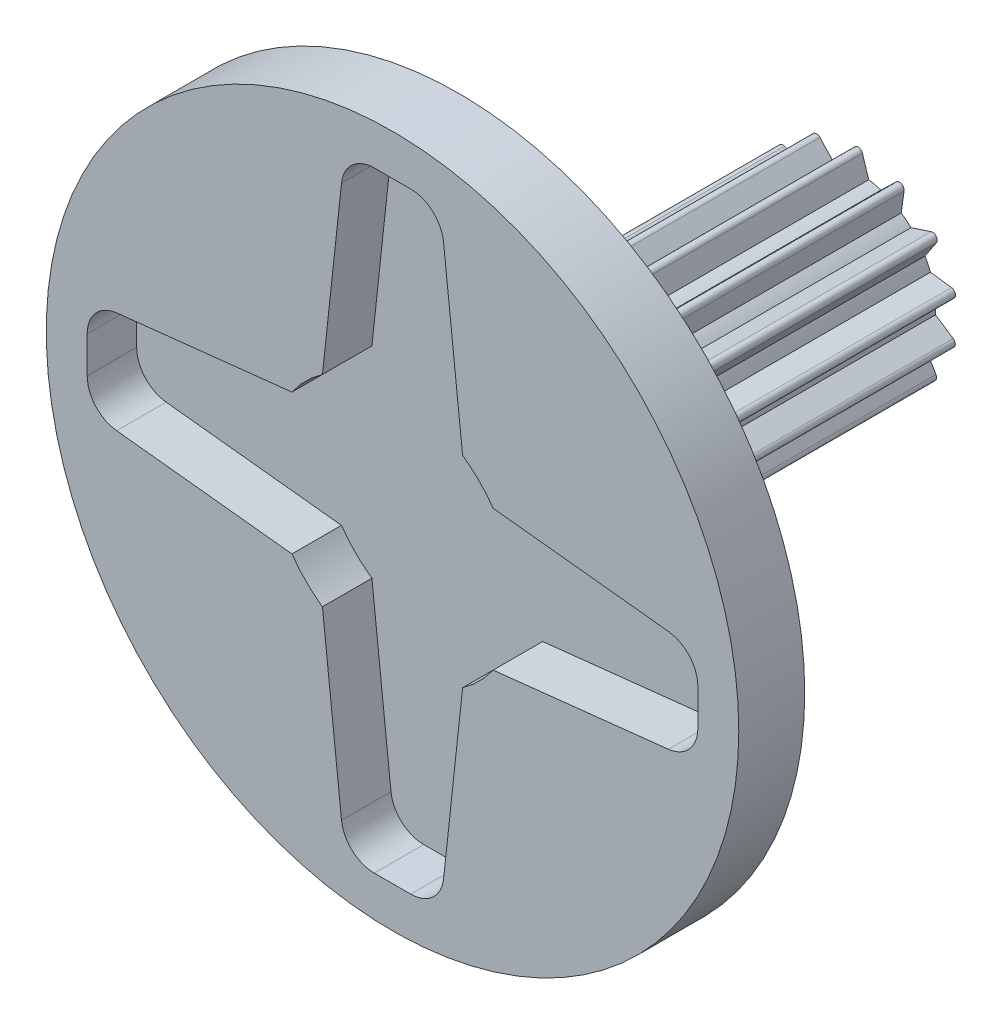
ISO-10303-21;
HEADER;
FILE_DESCRIPTION(('STEP AP214'),'2;1');
FILE_NAME('part.step','',(''),(''),'','','');
FILE_SCHEMA(('AUTOMOTIVE_DESIGN { 1 0 10303 214 1 1 1 1 }'));
ENDSEC;
DATA;
#1=APPLICATION_CONTEXT('core data for automotive mechanical design processes');
#2=APPLICATION_PROTOCOL_DEFINITION('international standard','automotive_design',2000,#1);
#3=PRODUCT_CONTEXT('',#1,'mechanical');
#4=PRODUCT('Part','Part','',(#3));
#5=PRODUCT_RELATED_PRODUCT_CATEGORY('part','',(#4));
#6=PRODUCT_DEFINITION_FORMATION('','',#4);
#7=PRODUCT_DEFINITION_CONTEXT('part definition',#1,'design');
#8=PRODUCT_DEFINITION('design','',#6,#7);
#9=PRODUCT_DEFINITION_SHAPE('','',#8);
#10=(LENGTH_UNIT() NAMED_UNIT(*) SI_UNIT(.MILLI.,.METRE.));
#11=(NAMED_UNIT(*) PLANE_ANGLE_UNIT() SI_UNIT($,.RADIAN.));
#12=(NAMED_UNIT(*) SI_UNIT($,.STERADIAN.) SOLID_ANGLE_UNIT());
#13=UNCERTAINTY_MEASURE_WITH_UNIT(LENGTH_MEASURE(1.E-05),#10,'distance_accuracy_value','');
#14=(GEOMETRIC_REPRESENTATION_CONTEXT(3) GLOBAL_UNCERTAINTY_ASSIGNED_CONTEXT((#13)) GLOBAL_UNIT_ASSIGNED_CONTEXT((#10,
#11,#12)) REPRESENTATION_CONTEXT('',''));
#15=CARTESIAN_POINT('',(0.,0.,0.));
#16=DIRECTION('',(0.,0.,1.));
#17=DIRECTION('',(1.,0.,0.));
#18=AXIS2_PLACEMENT_3D('',#15,#16,#17);
#19=CARTESIAN_POINT('',(0.,0.,3.));
#20=DIRECTION('',(0.,0.,1.));
#21=DIRECTION('',(1.,0.,0.));
#22=AXIS2_PLACEMENT_3D('',#19,#20,#21);
#23=PLANE('',#22);
#24=CARTESIAN_POINT('',(0.,0.,3.));
#25=DIRECTION('',(0.,0.,1.));
#26=DIRECTION('',(1.,0.,0.));
#27=AXIS2_PLACEMENT_3D('',#24,#25,#26);
#28=CIRCLE('',#27,21.);
#29=CARTESIAN_POINT('',(21.,0.,3.));
#30=VERTEX_POINT('',#29);
#31=EDGE_CURVE('E1057',#30,#30,#28,.T.);
#32=ORIENTED_EDGE('',*,*,#31,.T.);
#33=EDGE_LOOP('',(#32));
#34=FACE_BOUND('',#33,.T.);
#35=DIRECTION('',(-0.806926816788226,0.590651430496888,0.));
#36=VECTOR('',#35,1.);
#37=CARTESIAN_POINT('',(4.53136353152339,5.89541633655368,3.));
#38=LINE('',#37,#36);
#39=CARTESIAN_POINT('',(4.53136353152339,5.89541633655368,3.));
#40=VERTEX_POINT('',#39);
#41=CARTESIAN_POINT('',(4.25000000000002,6.10136781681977,3.));
#42=VERTEX_POINT('',#41);
#43=EDGE_CURVE('E885',#40,#42,#38,.T.);
#44=ORIENTED_EDGE('',*,*,#43,.F.);
#45=CARTESIAN_POINT('',(0.,0.,3.));
#46=DIRECTION('',(0.,0.,1.));
#47=DIRECTION('',(1.,0.,0.));
#48=AXIS2_PLACEMENT_3D('',#45,#46,#47);
#49=CIRCLE('',#48,7.43567005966);
#50=CARTESIAN_POINT('',(6.10136781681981,4.24999999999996,3.));
#51=VERTEX_POINT('',#50);
#52=EDGE_CURVE('E883',#51,#40,#49,.T.);
#53=ORIENTED_EDGE('',*,*,#52,.F.);
#54=DIRECTION('',(-0.994139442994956,0.108105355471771,0.));
#55=VECTOR('',#54,1.);
#56=CARTESIAN_POINT('',(16.732617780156,3.0939297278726,3.));
#57=LINE('',#56,#55);
#58=CARTESIAN_POINT('',(16.732617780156,3.0939297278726,3.));
#59=VERTEX_POINT('',#58);
#60=EDGE_CURVE('E932',#59,#51,#57,.T.);
#61=ORIENTED_EDGE('',*,*,#60,.F.);
#62=CARTESIAN_POINT('',(16.5164070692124,1.10565084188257,3.));
#63=DIRECTION('',(0.,0.,1.));
#64=DIRECTION('',(-1.,0.,0.));
#65=AXIS2_PLACEMENT_3D('',#62,#63,#64);
#66=CIRCLE('',#65,2.00000000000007);
#67=CARTESIAN_POINT('',(18.5164070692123,1.10565084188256,3.));
#68=VERTEX_POINT('',#67);
#69=EDGE_CURVE('E930',#68,#59,#66,.T.);
#70=ORIENTED_EDGE('',*,*,#69,.F.);
#71=DIRECTION('',(0.,1.,0.));
#72=VECTOR('',#71,1.);
#73=CARTESIAN_POINT('',(18.5164070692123,-1.10565084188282,3.));
#74=LINE('',#73,#72);
#75=CARTESIAN_POINT('',(18.5164070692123,-1.10565084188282,3.));
#76=VERTEX_POINT('',#75);
#77=EDGE_CURVE('E928',#76,#68,#74,.T.);
#78=ORIENTED_EDGE('',*,*,#77,.F.);
#79=CARTESIAN_POINT('',(16.5164070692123,-1.1056508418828,3.));
#80=DIRECTION('',(0.,0.,1.));
#81=DIRECTION('',(-1.,0.,0.));
#82=AXIS2_PLACEMENT_3D('',#79,#80,#81);
#83=CIRCLE('',#82,2.);
#84=CARTESIAN_POINT('',(16.7326177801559,-3.09392972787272,3.));
#85=VERTEX_POINT('',#84);
#86=EDGE_CURVE('E926',#85,#76,#83,.T.);
#87=ORIENTED_EDGE('',*,*,#86,.F.);
#88=DIRECTION('',(0.994139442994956,0.10810535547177,0.));
#89=VECTOR('',#88,1.);
#90=CARTESIAN_POINT('',(6.10136781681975,-4.25000000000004,3.));
#91=LINE('',#90,#89);
#92=CARTESIAN_POINT('',(6.10136781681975,-4.25000000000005,3.));
#93=VERTEX_POINT('',#92);
#94=EDGE_CURVE('E924',#93,#85,#91,.T.);
#95=ORIENTED_EDGE('',*,*,#94,.F.);
#96=CARTESIAN_POINT('',(0.,0.,3.));
#97=DIRECTION('',(0.,0.,1.));
#98=DIRECTION('',(1.,0.,0.));
#99=AXIS2_PLACEMENT_3D('',#96,#97,#98);
#100=CIRCLE('',#99,7.43567005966);
#101=CARTESIAN_POINT('',(4.24999999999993,-6.10136781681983,3.));
#102=VERTEX_POINT('',#101);
#103=EDGE_CURVE('E922',#102,#93,#100,.T.);
#104=ORIENTED_EDGE('',*,*,#103,.F.);
#105=DIRECTION('',(0.108105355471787,0.994139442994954,0.));
#106=VECTOR('',#105,1.);
#107=CARTESIAN_POINT('',(3.09392972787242,-16.7326177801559,3.));
#108=LINE('',#107,#106);
#109=CARTESIAN_POINT('',(3.09392972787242,-16.7326177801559,3.));
#110=VERTEX_POINT('',#109);
#111=EDGE_CURVE('E920',#110,#102,#108,.T.);
#112=ORIENTED_EDGE('',*,*,#111,.F.);
#113=CARTESIAN_POINT('',(1.10565084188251,-16.5164070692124,3.));
#114=DIRECTION('',(0.,0.,1.));
#115=DIRECTION('',(-1.,0.,0.));
#116=AXIS2_PLACEMENT_3D('',#113,#114,#115);
#117=CIRCLE('',#116,2.);
#118=CARTESIAN_POINT('',(1.10565084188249,-18.5164070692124,3.));
#119=VERTEX_POINT('',#118);
#120=EDGE_CURVE('E918',#119,#110,#117,.T.);
#121=ORIENTED_EDGE('',*,*,#120,.F.);
#122=DIRECTION('',(1.,0.,0.));
#123=VECTOR('',#122,1.);
#124=CARTESIAN_POINT('',(-1.10565084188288,-18.5164070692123,3.));
#125=LINE('',#124,#123);
#126=CARTESIAN_POINT('',(-1.10565084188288,-18.5164070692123,3.));
#127=VERTEX_POINT('',#126);
#128=EDGE_CURVE('E916',#127,#119,#125,.T.);
#129=ORIENTED_EDGE('',*,*,#128,.F.);
#130=CARTESIAN_POINT('',(-1.10565084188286,-16.5164070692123,3.));
#131=DIRECTION('',(0.,0.,1.));
#132=DIRECTION('',(-1.,0.,0.));
#133=AXIS2_PLACEMENT_3D('',#130,#131,#132);
#134=CIRCLE('',#133,2.);
#135=CARTESIAN_POINT('',(-3.09392972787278,-16.7326177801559,3.));
#136=VERTEX_POINT('',#135);
#137=EDGE_CURVE('E914',#136,#127,#134,.T.);
#138=ORIENTED_EDGE('',*,*,#137,.F.);
#139=DIRECTION('',(0.108105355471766,-0.994139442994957,0.));
#140=VECTOR('',#139,1.);
#141=CARTESIAN_POINT('',(-4.25000000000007,-6.10136781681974,3.));
#142=LINE('',#141,#140);
#143=CARTESIAN_POINT('',(-4.25000000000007,-6.10136781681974,3.));
#144=VERTEX_POINT('',#143);
#145=EDGE_CURVE('E912',#144,#136,#142,.T.);
#146=ORIENTED_EDGE('',*,*,#145,.F.);
#147=CARTESIAN_POINT('',(0.,0.,3.));
#148=DIRECTION('',(0.,0.,1.));
#149=DIRECTION('',(1.,0.,0.));
#150=AXIS2_PLACEMENT_3D('',#147,#148,#149);
#151=CIRCLE('',#150,7.43567005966);
#152=CARTESIAN_POINT('',(-6.10136781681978,-4.25,3.));
#153=VERTEX_POINT('',#152);
#154=EDGE_CURVE('E910',#153,#144,#151,.T.);
#155=ORIENTED_EDGE('',*,*,#154,.F.);
#156=DIRECTION('',(0.994139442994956,-0.108105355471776,0.));
#157=VECTOR('',#156,1.);
#158=CARTESIAN_POINT('',(-16.7326177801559,-3.0939297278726,3.));
#159=LINE('',#158,#157);
#160=CARTESIAN_POINT('',(-16.7326177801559,-3.09392972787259,3.));
#161=VERTEX_POINT('',#160);
#162=EDGE_CURVE('E908',#161,#153,#159,.T.);
#163=ORIENTED_EDGE('',*,*,#162,.F.);
#164=CARTESIAN_POINT('',(-16.5164070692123,-1.10565084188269,3.));
#165=DIRECTION('',(0.,0.,1.));
#166=DIRECTION('',(-1.,0.,0.));
#167=AXIS2_PLACEMENT_3D('',#164,#165,#166);
#168=CIRCLE('',#167,1.99999999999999);
#169=CARTESIAN_POINT('',(-18.5164070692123,-1.10565084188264,3.));
#170=VERTEX_POINT('',#169);
#171=EDGE_CURVE('E906',#170,#161,#168,.T.);
#172=ORIENTED_EDGE('',*,*,#171,.F.);
#173=DIRECTION('',(0.,-1.,0.));
#174=VECTOR('',#173,1.);
#175=CARTESIAN_POINT('',(-18.5164070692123,1.10565084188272,3.));
#176=LINE('',#175,#174);
#177=CARTESIAN_POINT('',(-18.5164070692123,1.10565084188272,3.));
#178=VERTEX_POINT('',#177);
#179=EDGE_CURVE('E904',#178,#170,#176,.T.);
#180=ORIENTED_EDGE('',*,*,#179,.F.);
#181=CARTESIAN_POINT('',(-16.5164070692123,1.10565084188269,3.));
#182=DIRECTION('',(0.,0.,1.));
#183=DIRECTION('',(-1.,0.,0.));
#184=AXIS2_PLACEMENT_3D('',#181,#182,#183);
#185=CIRCLE('',#184,2.);
#186=CARTESIAN_POINT('',(-16.7326177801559,3.0939297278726,3.));
#187=VERTEX_POINT('',#186);
#188=EDGE_CURVE('E902',#187,#178,#185,.T.);
#189=ORIENTED_EDGE('',*,*,#188,.F.);
#190=DIRECTION('',(-0.994139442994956,-0.108105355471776,0.));
#191=VECTOR('',#190,1.);
#192=CARTESIAN_POINT('',(-6.10136781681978,4.25,3.));
#193=LINE('',#192,#191);
#194=CARTESIAN_POINT('',(-6.10136781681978,4.25,3.));
#195=VERTEX_POINT('',#194);
#196=EDGE_CURVE('E900',#195,#187,#193,.T.);
#197=ORIENTED_EDGE('',*,*,#196,.F.);
#198=CARTESIAN_POINT('',(0.,0.,3.));
#199=DIRECTION('',(0.,0.,1.));
#200=DIRECTION('',(1.,0.,0.));
#201=AXIS2_PLACEMENT_3D('',#198,#199,#200);
#202=CIRCLE('',#201,7.43567005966);
#203=CARTESIAN_POINT('',(-4.24999999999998,6.1013678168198,3.));
#204=VERTEX_POINT('',#203);
#205=EDGE_CURVE('E898',#204,#195,#202,.T.);
#206=ORIENTED_EDGE('',*,*,#205,.F.);
#207=DIRECTION('',(-0.108105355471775,-0.994139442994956,0.));
#208=VECTOR('',#207,1.);
#209=CARTESIAN_POINT('',(-3.0939297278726,16.7326177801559,3.));
#210=LINE('',#209,#208);
#211=CARTESIAN_POINT('',(-3.09392972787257,16.7326177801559,3.));
#212=VERTEX_POINT('',#211);
#213=EDGE_CURVE('E896',#212,#204,#210,.T.);
#214=ORIENTED_EDGE('',*,*,#213,.F.);
#215=CARTESIAN_POINT('',(-1.10565084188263,16.5164070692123,3.));
#216=DIRECTION('',(0.,0.,1.));
#217=DIRECTION('',(-1.,0.,0.));
#218=AXIS2_PLACEMENT_3D('',#215,#216,#217);
#219=CIRCLE('',#218,2.00000000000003);
#220=CARTESIAN_POINT('',(-1.10565084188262,18.5164070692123,3.));
#221=VERTEX_POINT('',#220);
#222=EDGE_CURVE('E894',#221,#212,#219,.T.);
#223=ORIENTED_EDGE('',*,*,#222,.F.);
#224=DIRECTION('',(-1.,0.,0.));
#225=VECTOR('',#224,1.);
#226=CARTESIAN_POINT('',(1.10565084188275,18.5164070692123,3.));
#227=LINE('',#226,#225);
#228=CARTESIAN_POINT('',(1.10565084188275,18.5164070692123,3.));
#229=VERTEX_POINT('',#228);
#230=EDGE_CURVE('E892',#229,#221,#227,.T.);
#231=ORIENTED_EDGE('',*,*,#230,.F.);
#232=CARTESIAN_POINT('',(1.10565084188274,16.5164070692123,3.));
#233=DIRECTION('',(0.,0.,1.));
#234=DIRECTION('',(-1.,0.,0.));
#235=AXIS2_PLACEMENT_3D('',#232,#233,#234);
#236=CIRCLE('',#235,2.);
#237=CARTESIAN_POINT('',(3.09392972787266,16.7326177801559,3.));
#238=VERTEX_POINT('',#237);
#239=EDGE_CURVE('E890',#238,#229,#236,.T.);
#240=ORIENTED_EDGE('',*,*,#239,.F.);
#241=DIRECTION('',(-0.108105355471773,0.994139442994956,0.));
#242=VECTOR('',#241,1.);
#243=CARTESIAN_POINT('',(4.25000000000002,6.10136781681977,3.));
#244=LINE('',#243,#242);
#245=EDGE_CURVE('E888',#42,#238,#244,.T.);
#246=ORIENTED_EDGE('',*,*,#245,.F.);
#247=EDGE_LOOP('',(#44,#53,#61,#70,#78,#87,#95,#104,#112,#121,#129,#138,#146,#155,#163,#172,
#180,#189,#197,#206,#214,#223,#231,#240,#246));
#248=FACE_BOUND('',#247,.T.);
#249=ADVANCED_FACE('F33',(#34,#248),#23,.T.);
#250=CARTESIAN_POINT('',(0.,0.,3.));
#251=DIRECTION('',(0.,0.,-1.));
#252=DIRECTION('',(-1.,0.,0.));
#253=AXIS2_PLACEMENT_3D('',#250,#251,#252);
#254=CYLINDRICAL_SURFACE('',#253,21.);
#255=ORIENTED_EDGE('',*,*,#31,.F.);
#256=EDGE_LOOP('',(#255));
#257=FACE_BOUND('',#256,.T.);
#258=CARTESIAN_POINT('',(0.,0.,-1.));
#259=DIRECTION('',(0.,0.,1.));
#260=DIRECTION('',(1.,0.,0.));
#261=AXIS2_PLACEMENT_3D('',#258,#259,#260);
#262=CIRCLE('',#261,21.);
#263=CARTESIAN_POINT('',(21.,0.,-1.));
#264=VERTEX_POINT('',#263);
#265=EDGE_CURVE('E719',#264,#264,#262,.T.);
#266=ORIENTED_EDGE('',*,*,#265,.T.);
#267=EDGE_LOOP('',(#266));
#268=FACE_BOUND('',#267,.T.);
#269=ADVANCED_FACE('F35',(#257,#268),#254,.T.);
#270=CARTESIAN_POINT('',(0.,0.,3.));
#271=DIRECTION('',(0.,0.,-1.));
#272=DIRECTION('',(-1.,0.,0.));
#273=AXIS2_PLACEMENT_3D('',#270,#271,#272);
#274=CYLINDRICAL_SURFACE('',#273,7.43567005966);
#275=CARTESIAN_POINT('',(0.,0.,0.));
#276=DIRECTION('',(0.,0.,1.));
#277=DIRECTION('',(1.,0.,0.));
#278=AXIS2_PLACEMENT_3D('',#275,#276,#277);
#279=CIRCLE('',#278,7.43567005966);
#280=CARTESIAN_POINT('',(6.10136781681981,4.24999999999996,0.));
#281=VERTEX_POINT('',#280);
#282=CARTESIAN_POINT('',(4.53136353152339,5.89541633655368,0.));
#283=VERTEX_POINT('',#282);
#284=EDGE_CURVE('E882',#281,#283,#279,.T.);
#285=ORIENTED_EDGE('',*,*,#284,.F.);
#286=DIRECTION('',(0.,0.,-1.));
#287=VECTOR('',#286,1.);
#288=CARTESIAN_POINT('',(6.10136781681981,4.24999999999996,3.));
#289=LINE('',#288,#287);
#290=EDGE_CURVE('E934',#51,#281,#289,.T.);
#291=ORIENTED_EDGE('',*,*,#290,.F.);
#292=ORIENTED_EDGE('',*,*,#52,.T.);
#293=DIRECTION('',(0.,0.,-1.));
#294=VECTOR('',#293,1.);
#295=CARTESIAN_POINT('',(4.53136353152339,5.89541633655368,3.));
#296=LINE('',#295,#294);
#297=EDGE_CURVE('E1054',#40,#283,#296,.T.);
#298=ORIENTED_EDGE('',*,*,#297,.T.);
#299=EDGE_LOOP('',(#285,#291,#292,#298));
#300=FACE_BOUND('',#299,.T.);
#301=ADVANCED_FACE('F1395',(#300),#274,.F.);
#302=CARTESIAN_POINT('',(4.53136353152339,5.89541633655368,3.));
#303=DIRECTION('',(-0.590651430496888,-0.806926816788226,0.));
#304=DIRECTION('',(0.806926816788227,-0.590651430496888,0.));
#305=AXIS2_PLACEMENT_3D('',#302,#303,#304);
#306=PLANE('',#305);
#307=DIRECTION('',(-0.806926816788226,0.590651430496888,0.));
#308=VECTOR('',#307,1.);
#309=CARTESIAN_POINT('',(4.53136353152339,5.89541633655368,0.));
#310=LINE('',#309,#308);
#311=CARTESIAN_POINT('',(4.25000000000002,6.10136781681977,0.));
#312=VERTEX_POINT('',#311);
#313=EDGE_CURVE('E937',#283,#312,#310,.T.);
#314=ORIENTED_EDGE('',*,*,#313,.F.);
#315=ORIENTED_EDGE('',*,*,#297,.F.);
#316=ORIENTED_EDGE('',*,*,#43,.T.);
#317=DIRECTION('',(0.,0.,-1.));
#318=VECTOR('',#317,1.);
#319=CARTESIAN_POINT('',(4.25000000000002,6.10136781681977,3.));
#320=LINE('',#319,#318);
#321=EDGE_CURVE('E1052',#42,#312,#320,.T.);
#322=ORIENTED_EDGE('',*,*,#321,.T.);
#323=EDGE_LOOP('',(#314,#315,#316,#322));
#324=FACE_BOUND('',#323,.T.);
#325=ADVANCED_FACE('F1401',(#324),#306,.T.);
#326=CARTESIAN_POINT('',(4.25000000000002,6.10136781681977,3.));
#327=DIRECTION('',(-0.994139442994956,-0.108105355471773,0.));
#328=DIRECTION('',(0.108105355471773,-0.994139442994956,0.));
#329=AXIS2_PLACEMENT_3D('',#326,#327,#328);
#330=PLANE('',#329);
#331=DIRECTION('',(-0.108105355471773,0.994139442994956,0.));
#332=VECTOR('',#331,1.);
#333=CARTESIAN_POINT('',(4.25000000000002,6.10136781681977,0.));
#334=LINE('',#333,#332);
#335=CARTESIAN_POINT('',(3.09392972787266,16.7326177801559,0.));
#336=VERTEX_POINT('',#335);
#337=EDGE_CURVE('E940',#312,#336,#334,.T.);
#338=ORIENTED_EDGE('',*,*,#337,.F.);
#339=ORIENTED_EDGE('',*,*,#321,.F.);
#340=ORIENTED_EDGE('',*,*,#245,.T.);
#341=DIRECTION('',(0.,0.,-1.));
#342=VECTOR('',#341,1.);
#343=CARTESIAN_POINT('',(3.09392972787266,16.7326177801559,3.));
#344=LINE('',#343,#342);
#345=EDGE_CURVE('E1050',#238,#336,#344,.T.);
#346=ORIENTED_EDGE('',*,*,#345,.T.);
#347=EDGE_LOOP('',(#338,#339,#340,#346));
#348=FACE_BOUND('',#347,.T.);
#349=ADVANCED_FACE('F1405',(#348),#330,.T.);
#350=CARTESIAN_POINT('',(1.10565084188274,16.5164070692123,3.));
#351=DIRECTION('',(0.,0.,-1.));
#352=DIRECTION('',(-1.,0.,0.));
#353=AXIS2_PLACEMENT_3D('',#350,#351,#352);
#354=CYLINDRICAL_SURFACE('',#353,2.);
#355=CARTESIAN_POINT('',(1.10565084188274,16.5164070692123,0.));
#356=DIRECTION('',(0.,0.,1.));
#357=DIRECTION('',(-1.,0.,0.));
#358=AXIS2_PLACEMENT_3D('',#355,#356,#357);
#359=CIRCLE('',#358,2.);
#360=CARTESIAN_POINT('',(1.10565084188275,18.5164070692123,0.));
#361=VERTEX_POINT('',#360);
#362=EDGE_CURVE('E943',#336,#361,#359,.T.);
#363=ORIENTED_EDGE('',*,*,#362,.F.);
#364=ORIENTED_EDGE('',*,*,#345,.F.);
#365=ORIENTED_EDGE('',*,*,#239,.T.);
#366=DIRECTION('',(0.,0.,-1.));
#367=VECTOR('',#366,1.);
#368=CARTESIAN_POINT('',(1.10565084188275,18.5164070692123,3.));
#369=LINE('',#368,#367);
#370=EDGE_CURVE('E1048',#229,#361,#369,.T.);
#371=ORIENTED_EDGE('',*,*,#370,.T.);
#372=EDGE_LOOP('',(#363,#364,#365,#371));
#373=FACE_BOUND('',#372,.T.);
#374=ADVANCED_FACE('F1409',(#373),#354,.F.);
#375=CARTESIAN_POINT('',(1.10565084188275,18.5164070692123,3.));
#376=DIRECTION('',(0.,-1.,0.));
#377=DIRECTION('',(1.,0.,0.));
#378=AXIS2_PLACEMENT_3D('',#375,#376,#377);
#379=PLANE('',#378);
#380=DIRECTION('',(-1.,0.,0.));
#381=VECTOR('',#380,1.);
#382=CARTESIAN_POINT('',(1.10565084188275,18.5164070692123,0.));
#383=LINE('',#382,#381);
#384=CARTESIAN_POINT('',(-1.10565084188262,18.5164070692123,0.));
#385=VERTEX_POINT('',#384);
#386=EDGE_CURVE('E946',#361,#385,#383,.T.);
#387=ORIENTED_EDGE('',*,*,#386,.F.);
#388=ORIENTED_EDGE('',*,*,#370,.F.);
#389=ORIENTED_EDGE('',*,*,#230,.T.);
#390=DIRECTION('',(0.,0.,-1.));
#391=VECTOR('',#390,1.);
#392=CARTESIAN_POINT('',(-1.10565084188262,18.5164070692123,3.));
#393=LINE('',#392,#391);
#394=EDGE_CURVE('E1046',#221,#385,#393,.T.);
#395=ORIENTED_EDGE('',*,*,#394,.T.);
#396=EDGE_LOOP('',(#387,#388,#389,#395));
#397=FACE_BOUND('',#396,.T.);
#398=ADVANCED_FACE('F1413',(#397),#379,.T.);
#399=CARTESIAN_POINT('',(-1.10565084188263,16.5164070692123,3.));
#400=DIRECTION('',(0.,0.,-1.));
#401=DIRECTION('',(-1.,0.,0.));
#402=AXIS2_PLACEMENT_3D('',#399,#400,#401);
#403=CYLINDRICAL_SURFACE('',#402,2.00000000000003);
#404=CARTESIAN_POINT('',(-1.10565084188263,16.5164070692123,0.));
#405=DIRECTION('',(0.,0.,1.));
#406=DIRECTION('',(-1.,0.,0.));
#407=AXIS2_PLACEMENT_3D('',#404,#405,#406);
#408=CIRCLE('',#407,2.00000000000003);
#409=CARTESIAN_POINT('',(-3.09392972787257,16.7326177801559,0.));
#410=VERTEX_POINT('',#409);
#411=EDGE_CURVE('E949',#385,#410,#408,.T.);
#412=ORIENTED_EDGE('',*,*,#411,.F.);
#413=ORIENTED_EDGE('',*,*,#394,.F.);
#414=ORIENTED_EDGE('',*,*,#222,.T.);
#415=DIRECTION('',(0.,0.,-1.));
#416=VECTOR('',#415,1.);
#417=CARTESIAN_POINT('',(-3.09392972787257,16.7326177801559,3.));
#418=LINE('',#417,#416);
#419=EDGE_CURVE('E1044',#212,#410,#418,.T.);
#420=ORIENTED_EDGE('',*,*,#419,.T.);
#421=EDGE_LOOP('',(#412,#413,#414,#420));
#422=FACE_BOUND('',#421,.T.);
#423=ADVANCED_FACE('F1417',(#422),#403,.F.);
#424=CARTESIAN_POINT('',(-3.0939297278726,16.7326177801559,3.));
#425=DIRECTION('',(0.994139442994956,-0.108105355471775,0.));
#426=DIRECTION('',(0.108105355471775,0.994139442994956,0.));
#427=AXIS2_PLACEMENT_3D('',#424,#425,#426);
#428=PLANE('',#427);
#429=DIRECTION('',(-0.108105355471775,-0.994139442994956,0.));
#430=VECTOR('',#429,1.);
#431=CARTESIAN_POINT('',(-3.0939297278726,16.7326177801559,0.));
#432=LINE('',#431,#430);
#433=CARTESIAN_POINT('',(-4.24999999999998,6.1013678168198,0.));
#434=VERTEX_POINT('',#433);
#435=EDGE_CURVE('E952',#410,#434,#432,.T.);
#436=ORIENTED_EDGE('',*,*,#435,.F.);
#437=ORIENTED_EDGE('',*,*,#419,.F.);
#438=ORIENTED_EDGE('',*,*,#213,.T.);
#439=DIRECTION('',(0.,0.,-1.));
#440=VECTOR('',#439,1.);
#441=CARTESIAN_POINT('',(-4.24999999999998,6.1013678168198,3.));
#442=LINE('',#441,#440);
#443=EDGE_CURVE('E1042',#204,#434,#442,.T.);
#444=ORIENTED_EDGE('',*,*,#443,.T.);
#445=EDGE_LOOP('',(#436,#437,#438,#444));
#446=FACE_BOUND('',#445,.T.);
#447=ADVANCED_FACE('F1421',(#446),#428,.T.);
#448=CARTESIAN_POINT('',(0.,0.,3.));
#449=DIRECTION('',(0.,0.,-1.));
#450=DIRECTION('',(-1.,0.,0.));
#451=AXIS2_PLACEMENT_3D('',#448,#449,#450);
#452=CYLINDRICAL_SURFACE('',#451,7.43567005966);
#453=CARTESIAN_POINT('',(0.,0.,0.));
#454=DIRECTION('',(0.,0.,1.));
#455=DIRECTION('',(1.,0.,0.));
#456=AXIS2_PLACEMENT_3D('',#453,#454,#455);
#457=CIRCLE('',#456,7.43567005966);
#458=CARTESIAN_POINT('',(-6.10136781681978,4.25,0.));
#459=VERTEX_POINT('',#458);
#460=EDGE_CURVE('E955',#434,#459,#457,.T.);
#461=ORIENTED_EDGE('',*,*,#460,.F.);
#462=ORIENTED_EDGE('',*,*,#443,.F.);
#463=ORIENTED_EDGE('',*,*,#205,.T.);
#464=DIRECTION('',(0.,0.,-1.));
#465=VECTOR('',#464,1.);
#466=CARTESIAN_POINT('',(-6.10136781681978,4.25,3.));
#467=LINE('',#466,#465);
#468=EDGE_CURVE('E1040',#195,#459,#467,.T.);
#469=ORIENTED_EDGE('',*,*,#468,.T.);
#470=EDGE_LOOP('',(#461,#462,#463,#469));
#471=FACE_BOUND('',#470,.T.);
#472=ADVANCED_FACE('F1425',(#471),#452,.F.);
#473=CARTESIAN_POINT('',(-6.10136781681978,4.25,3.));
#474=DIRECTION('',(0.108105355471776,-0.994139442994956,0.));
#475=DIRECTION('',(0.994139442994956,0.108105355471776,0.));
#476=AXIS2_PLACEMENT_3D('',#473,#474,#475);
#477=PLANE('',#476);
#478=DIRECTION('',(-0.994139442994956,-0.108105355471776,0.));
#479=VECTOR('',#478,1.);
#480=CARTESIAN_POINT('',(-6.10136781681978,4.25,0.));
#481=LINE('',#480,#479);
#482=CARTESIAN_POINT('',(-16.7326177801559,3.0939297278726,0.));
#483=VERTEX_POINT('',#482);
#484=EDGE_CURVE('E958',#459,#483,#481,.T.);
#485=ORIENTED_EDGE('',*,*,#484,.F.);
#486=ORIENTED_EDGE('',*,*,#468,.F.);
#487=ORIENTED_EDGE('',*,*,#196,.T.);
#488=DIRECTION('',(0.,0.,-1.));
#489=VECTOR('',#488,1.);
#490=CARTESIAN_POINT('',(-16.7326177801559,3.0939297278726,3.));
#491=LINE('',#490,#489);
#492=EDGE_CURVE('E1038',#187,#483,#491,.T.);
#493=ORIENTED_EDGE('',*,*,#492,.T.);
#494=EDGE_LOOP('',(#485,#486,#487,#493));
#495=FACE_BOUND('',#494,.T.);
#496=ADVANCED_FACE('F1429',(#495),#477,.T.);
#497=CARTESIAN_POINT('',(-16.5164070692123,1.10565084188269,3.));
#498=DIRECTION('',(0.,0.,-1.));
#499=DIRECTION('',(-1.,0.,0.));
#500=AXIS2_PLACEMENT_3D('',#497,#498,#499);
#501=CYLINDRICAL_SURFACE('',#500,2.);
#502=CARTESIAN_POINT('',(-16.5164070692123,1.10565084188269,0.));
#503=DIRECTION('',(0.,0.,1.));
#504=DIRECTION('',(-1.,0.,0.));
#505=AXIS2_PLACEMENT_3D('',#502,#503,#504);
#506=CIRCLE('',#505,2.);
#507=CARTESIAN_POINT('',(-18.5164070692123,1.10565084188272,0.));
#508=VERTEX_POINT('',#507);
#509=EDGE_CURVE('E961',#483,#508,#506,.T.);
#510=ORIENTED_EDGE('',*,*,#509,.F.);
#511=ORIENTED_EDGE('',*,*,#492,.F.);
#512=ORIENTED_EDGE('',*,*,#188,.T.);
#513=DIRECTION('',(0.,0.,-1.));
#514=VECTOR('',#513,1.);
#515=CARTESIAN_POINT('',(-18.5164070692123,1.10565084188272,3.));
#516=LINE('',#515,#514);
#517=EDGE_CURVE('E1036',#178,#508,#516,.T.);
#518=ORIENTED_EDGE('',*,*,#517,.T.);
#519=EDGE_LOOP('',(#510,#511,#512,#518));
#520=FACE_BOUND('',#519,.T.);
#521=ADVANCED_FACE('F1433',(#520),#501,.F.);
#522=CARTESIAN_POINT('',(-18.5164070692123,1.10565084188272,3.));
#523=DIRECTION('',(1.,0.,0.));
#524=DIRECTION('',(0.,1.,0.));
#525=AXIS2_PLACEMENT_3D('',#522,#523,#524);
#526=PLANE('',#525);
#527=DIRECTION('',(0.,-1.,0.));
#528=VECTOR('',#527,1.);
#529=CARTESIAN_POINT('',(-18.5164070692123,1.10565084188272,0.));
#530=LINE('',#529,#528);
#531=CARTESIAN_POINT('',(-18.5164070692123,-1.10565084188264,0.));
#532=VERTEX_POINT('',#531);
#533=EDGE_CURVE('E964',#508,#532,#530,.T.);
#534=ORIENTED_EDGE('',*,*,#533,.F.);
#535=ORIENTED_EDGE('',*,*,#517,.F.);
#536=ORIENTED_EDGE('',*,*,#179,.T.);
#537=DIRECTION('',(0.,0.,-1.));
#538=VECTOR('',#537,1.);
#539=CARTESIAN_POINT('',(-18.5164070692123,-1.10565084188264,3.));
#540=LINE('',#539,#538);
#541=EDGE_CURVE('E1034',#170,#532,#540,.T.);
#542=ORIENTED_EDGE('',*,*,#541,.T.);
#543=EDGE_LOOP('',(#534,#535,#536,#542));
#544=FACE_BOUND('',#543,.T.);
#545=ADVANCED_FACE('F1437',(#544),#526,.T.);
#546=CARTESIAN_POINT('',(-16.5164070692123,-1.10565084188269,3.));
#547=DIRECTION('',(0.,0.,-1.));
#548=DIRECTION('',(-1.,0.,0.));
#549=AXIS2_PLACEMENT_3D('',#546,#547,#548);
#550=CYLINDRICAL_SURFACE('',#549,1.99999999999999);
#551=CARTESIAN_POINT('',(-16.5164070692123,-1.10565084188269,0.));
#552=DIRECTION('',(0.,0.,1.));
#553=DIRECTION('',(-1.,0.,0.));
#554=AXIS2_PLACEMENT_3D('',#551,#552,#553);
#555=CIRCLE('',#554,1.99999999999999);
#556=CARTESIAN_POINT('',(-16.7326177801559,-3.09392972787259,0.));
#557=VERTEX_POINT('',#556);
#558=EDGE_CURVE('E967',#532,#557,#555,.T.);
#559=ORIENTED_EDGE('',*,*,#558,.F.);
#560=ORIENTED_EDGE('',*,*,#541,.F.);
#561=ORIENTED_EDGE('',*,*,#171,.T.);
#562=DIRECTION('',(0.,0.,-1.));
#563=VECTOR('',#562,1.);
#564=CARTESIAN_POINT('',(-16.7326177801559,-3.09392972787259,3.));
#565=LINE('',#564,#563);
#566=EDGE_CURVE('E1032',#161,#557,#565,.T.);
#567=ORIENTED_EDGE('',*,*,#566,.T.);
#568=EDGE_LOOP('',(#559,#560,#561,#567));
#569=FACE_BOUND('',#568,.T.);
#570=ADVANCED_FACE('F1441',(#569),#550,.F.);
#571=CARTESIAN_POINT('',(-16.7326177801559,-3.0939297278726,3.));
#572=DIRECTION('',(0.108105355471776,0.994139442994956,0.));
#573=DIRECTION('',(-0.994139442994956,0.108105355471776,0.));
#574=AXIS2_PLACEMENT_3D('',#571,#572,#573);
#575=PLANE('',#574);
#576=DIRECTION('',(0.994139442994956,-0.108105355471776,0.));
#577=VECTOR('',#576,1.);
#578=CARTESIAN_POINT('',(-16.7326177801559,-3.0939297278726,0.));
#579=LINE('',#578,#577);
#580=CARTESIAN_POINT('',(-6.10136781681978,-4.25,0.));
#581=VERTEX_POINT('',#580);
#582=EDGE_CURVE('E970',#557,#581,#579,.T.);
#583=ORIENTED_EDGE('',*,*,#582,.F.);
#584=ORIENTED_EDGE('',*,*,#566,.F.);
#585=ORIENTED_EDGE('',*,*,#162,.T.);
#586=DIRECTION('',(0.,0.,-1.));
#587=VECTOR('',#586,1.);
#588=CARTESIAN_POINT('',(-6.10136781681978,-4.25,3.));
#589=LINE('',#588,#587);
#590=EDGE_CURVE('E1030',#153,#581,#589,.T.);
#591=ORIENTED_EDGE('',*,*,#590,.T.);
#592=EDGE_LOOP('',(#583,#584,#585,#591));
#593=FACE_BOUND('',#592,.T.);
#594=ADVANCED_FACE('F1445',(#593),#575,.T.);
#595=CARTESIAN_POINT('',(0.,0.,3.));
#596=DIRECTION('',(0.,0.,-1.));
#597=DIRECTION('',(-1.,0.,0.));
#598=AXIS2_PLACEMENT_3D('',#595,#596,#597);
#599=CYLINDRICAL_SURFACE('',#598,7.43567005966);
#600=CARTESIAN_POINT('',(0.,0.,0.));
#601=DIRECTION('',(0.,0.,1.));
#602=DIRECTION('',(1.,0.,0.));
#603=AXIS2_PLACEMENT_3D('',#600,#601,#602);
#604=CIRCLE('',#603,7.43567005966);
#605=CARTESIAN_POINT('',(-4.25000000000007,-6.10136781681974,0.));
#606=VERTEX_POINT('',#605);
#607=EDGE_CURVE('E973',#581,#606,#604,.T.);
#608=ORIENTED_EDGE('',*,*,#607,.F.);
#609=ORIENTED_EDGE('',*,*,#590,.F.);
#610=ORIENTED_EDGE('',*,*,#154,.T.);
#611=DIRECTION('',(0.,0.,-1.));
#612=VECTOR('',#611,1.);
#613=CARTESIAN_POINT('',(-4.25000000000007,-6.10136781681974,3.));
#614=LINE('',#613,#612);
#615=EDGE_CURVE('E1028',#144,#606,#614,.T.);
#616=ORIENTED_EDGE('',*,*,#615,.T.);
#617=EDGE_LOOP('',(#608,#609,#610,#616));
#618=FACE_BOUND('',#617,.T.);
#619=ADVANCED_FACE('F1449',(#618),#599,.F.);
#620=CARTESIAN_POINT('',(-4.25000000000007,-6.10136781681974,3.));
#621=DIRECTION('',(0.994139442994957,0.108105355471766,0.));
#622=DIRECTION('',(-0.108105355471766,0.994139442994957,0.));
#623=AXIS2_PLACEMENT_3D('',#620,#621,#622);
#624=PLANE('',#623);
#625=DIRECTION('',(0.108105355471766,-0.994139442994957,0.));
#626=VECTOR('',#625,1.);
#627=CARTESIAN_POINT('',(-4.25000000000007,-6.10136781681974,0.));
#628=LINE('',#627,#626);
#629=CARTESIAN_POINT('',(-3.09392972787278,-16.7326177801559,0.));
#630=VERTEX_POINT('',#629);
#631=EDGE_CURVE('E976',#606,#630,#628,.T.);
#632=ORIENTED_EDGE('',*,*,#631,.F.);
#633=ORIENTED_EDGE('',*,*,#615,.F.);
#634=ORIENTED_EDGE('',*,*,#145,.T.);
#635=DIRECTION('',(0.,0.,-1.));
#636=VECTOR('',#635,1.);
#637=CARTESIAN_POINT('',(-3.09392972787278,-16.7326177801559,3.));
#638=LINE('',#637,#636);
#639=EDGE_CURVE('E1026',#136,#630,#638,.T.);
#640=ORIENTED_EDGE('',*,*,#639,.T.);
#641=EDGE_LOOP('',(#632,#633,#634,#640));
#642=FACE_BOUND('',#641,.T.);
#643=ADVANCED_FACE('F1453',(#642),#624,.T.);
#644=CARTESIAN_POINT('',(-1.10565084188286,-16.5164070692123,3.));
#645=DIRECTION('',(0.,0.,-1.));
#646=DIRECTION('',(-1.,0.,0.));
#647=AXIS2_PLACEMENT_3D('',#644,#645,#646);
#648=CYLINDRICAL_SURFACE('',#647,2.);
#649=CARTESIAN_POINT('',(-1.10565084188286,-16.5164070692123,0.));
#650=DIRECTION('',(0.,0.,1.));
#651=DIRECTION('',(-1.,0.,0.));
#652=AXIS2_PLACEMENT_3D('',#649,#650,#651);
#653=CIRCLE('',#652,2.);
#654=CARTESIAN_POINT('',(-1.10565084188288,-18.5164070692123,0.));
#655=VERTEX_POINT('',#654);
#656=EDGE_CURVE('E979',#630,#655,#653,.T.);
#657=ORIENTED_EDGE('',*,*,#656,.F.);
#658=ORIENTED_EDGE('',*,*,#639,.F.);
#659=ORIENTED_EDGE('',*,*,#137,.T.);
#660=DIRECTION('',(0.,0.,-1.));
#661=VECTOR('',#660,1.);
#662=CARTESIAN_POINT('',(-1.10565084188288,-18.5164070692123,3.));
#663=LINE('',#662,#661);
#664=EDGE_CURVE('E1024',#127,#655,#663,.T.);
#665=ORIENTED_EDGE('',*,*,#664,.T.);
#666=EDGE_LOOP('',(#657,#658,#659,#665));
#667=FACE_BOUND('',#666,.T.);
#668=ADVANCED_FACE('F1457',(#667),#648,.F.);
#669=CARTESIAN_POINT('',(-1.10565084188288,-18.5164070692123,3.));
#670=DIRECTION('',(0.,1.,0.));
#671=DIRECTION('',(-1.,0.,0.));
#672=AXIS2_PLACEMENT_3D('',#669,#670,#671);
#673=PLANE('',#672);
#674=DIRECTION('',(1.,0.,0.));
#675=VECTOR('',#674,1.);
#676=CARTESIAN_POINT('',(-1.10565084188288,-18.5164070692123,0.));
#677=LINE('',#676,#675);
#678=CARTESIAN_POINT('',(1.10565084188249,-18.5164070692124,0.));
#679=VERTEX_POINT('',#678);
#680=EDGE_CURVE('E982',#655,#679,#677,.T.);
#681=ORIENTED_EDGE('',*,*,#680,.F.);
#682=ORIENTED_EDGE('',*,*,#664,.F.);
#683=ORIENTED_EDGE('',*,*,#128,.T.);
#684=DIRECTION('',(0.,0.,-1.));
#685=VECTOR('',#684,1.);
#686=CARTESIAN_POINT('',(1.10565084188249,-18.5164070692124,3.));
#687=LINE('',#686,#685);
#688=EDGE_CURVE('E1022',#119,#679,#687,.T.);
#689=ORIENTED_EDGE('',*,*,#688,.T.);
#690=EDGE_LOOP('',(#681,#682,#683,#689));
#691=FACE_BOUND('',#690,.T.);
#692=ADVANCED_FACE('F1461',(#691),#673,.T.);
#693=CARTESIAN_POINT('',(1.10565084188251,-16.5164070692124,3.));
#694=DIRECTION('',(0.,0.,-1.));
#695=DIRECTION('',(-1.,0.,0.));
#696=AXIS2_PLACEMENT_3D('',#693,#694,#695);
#697=CYLINDRICAL_SURFACE('',#696,2.);
#698=CARTESIAN_POINT('',(1.10565084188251,-16.5164070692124,0.));
#699=DIRECTION('',(0.,0.,1.));
#700=DIRECTION('',(-1.,0.,0.));
#701=AXIS2_PLACEMENT_3D('',#698,#699,#700);
#702=CIRCLE('',#701,2.);
#703=CARTESIAN_POINT('',(3.09392972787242,-16.7326177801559,0.));
#704=VERTEX_POINT('',#703);
#705=EDGE_CURVE('E985',#679,#704,#702,.T.);
#706=ORIENTED_EDGE('',*,*,#705,.F.);
#707=ORIENTED_EDGE('',*,*,#688,.F.);
#708=ORIENTED_EDGE('',*,*,#120,.T.);
#709=DIRECTION('',(0.,0.,-1.));
#710=VECTOR('',#709,1.);
#711=CARTESIAN_POINT('',(3.09392972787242,-16.7326177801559,3.));
#712=LINE('',#711,#710);
#713=EDGE_CURVE('E1020',#110,#704,#712,.T.);
#714=ORIENTED_EDGE('',*,*,#713,.T.);
#715=EDGE_LOOP('',(#706,#707,#708,#714));
#716=FACE_BOUND('',#715,.T.);
#717=ADVANCED_FACE('F1465',(#716),#697,.F.);
#718=CARTESIAN_POINT('',(3.09392972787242,-16.7326177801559,3.));
#719=DIRECTION('',(-0.994139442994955,0.108105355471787,0.));
#720=DIRECTION('',(-0.108105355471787,-0.994139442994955,0.));
#721=AXIS2_PLACEMENT_3D('',#718,#719,#720);
#722=PLANE('',#721);
#723=DIRECTION('',(0.108105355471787,0.994139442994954,0.));
#724=VECTOR('',#723,1.);
#725=CARTESIAN_POINT('',(3.09392972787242,-16.7326177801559,0.));
#726=LINE('',#725,#724);
#727=CARTESIAN_POINT('',(4.24999999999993,-6.10136781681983,0.));
#728=VERTEX_POINT('',#727);
#729=EDGE_CURVE('E988',#704,#728,#726,.T.);
#730=ORIENTED_EDGE('',*,*,#729,.F.);
#731=ORIENTED_EDGE('',*,*,#713,.F.);
#732=ORIENTED_EDGE('',*,*,#111,.T.);
#733=DIRECTION('',(0.,0.,-1.));
#734=VECTOR('',#733,1.);
#735=CARTESIAN_POINT('',(4.24999999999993,-6.10136781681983,3.));
#736=LINE('',#735,#734);
#737=EDGE_CURVE('E1018',#102,#728,#736,.T.);
#738=ORIENTED_EDGE('',*,*,#737,.T.);
#739=EDGE_LOOP('',(#730,#731,#732,#738));
#740=FACE_BOUND('',#739,.T.);
#741=ADVANCED_FACE('F1469',(#740),#722,.T.);
#742=CARTESIAN_POINT('',(0.,0.,3.));
#743=DIRECTION('',(0.,0.,-1.));
#744=DIRECTION('',(-1.,0.,0.));
#745=AXIS2_PLACEMENT_3D('',#742,#743,#744);
#746=CYLINDRICAL_SURFACE('',#745,7.43567005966);
#747=CARTESIAN_POINT('',(0.,0.,0.));
#748=DIRECTION('',(0.,0.,1.));
#749=DIRECTION('',(1.,0.,0.));
#750=AXIS2_PLACEMENT_3D('',#747,#748,#749);
#751=CIRCLE('',#750,7.43567005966);
#752=CARTESIAN_POINT('',(6.10136781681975,-4.25000000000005,0.));
#753=VERTEX_POINT('',#752);
#754=EDGE_CURVE('E991',#728,#753,#751,.T.);
#755=ORIENTED_EDGE('',*,*,#754,.F.);
#756=ORIENTED_EDGE('',*,*,#737,.F.);
#757=ORIENTED_EDGE('',*,*,#103,.T.);
#758=DIRECTION('',(0.,0.,-1.));
#759=VECTOR('',#758,1.);
#760=CARTESIAN_POINT('',(6.10136781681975,-4.25000000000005,3.));
#761=LINE('',#760,#759);
#762=EDGE_CURVE('E1016',#93,#753,#761,.T.);
#763=ORIENTED_EDGE('',*,*,#762,.T.);
#764=EDGE_LOOP('',(#755,#756,#757,#763));
#765=FACE_BOUND('',#764,.T.);
#766=ADVANCED_FACE('F1473',(#765),#746,.F.);
#767=CARTESIAN_POINT('',(6.10136781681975,-4.25000000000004,3.));
#768=DIRECTION('',(-0.108105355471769,0.994139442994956,0.));
#769=DIRECTION('',(-0.994139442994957,-0.10810535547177,0.));
#770=AXIS2_PLACEMENT_3D('',#767,#768,#769);
#771=PLANE('',#770);
#772=DIRECTION('',(0.994139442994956,0.10810535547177,0.));
#773=VECTOR('',#772,1.);
#774=CARTESIAN_POINT('',(6.10136781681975,-4.25000000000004,0.));
#775=LINE('',#774,#773);
#776=CARTESIAN_POINT('',(16.7326177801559,-3.09392972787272,0.));
#777=VERTEX_POINT('',#776);
#778=EDGE_CURVE('E994',#753,#777,#775,.T.);
#779=ORIENTED_EDGE('',*,*,#778,.F.);
#780=ORIENTED_EDGE('',*,*,#762,.F.);
#781=ORIENTED_EDGE('',*,*,#94,.T.);
#782=DIRECTION('',(0.,0.,-1.));
#783=VECTOR('',#782,1.);
#784=CARTESIAN_POINT('',(16.7326177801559,-3.09392972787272,3.));
#785=LINE('',#784,#783);
#786=EDGE_CURVE('E1014',#85,#777,#785,.T.);
#787=ORIENTED_EDGE('',*,*,#786,.T.);
#788=EDGE_LOOP('',(#779,#780,#781,#787));
#789=FACE_BOUND('',#788,.T.);
#790=ADVANCED_FACE('F1477',(#789),#771,.T.);
#791=CARTESIAN_POINT('',(16.5164070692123,-1.1056508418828,3.));
#792=DIRECTION('',(0.,0.,-1.));
#793=DIRECTION('',(-1.,0.,0.));
#794=AXIS2_PLACEMENT_3D('',#791,#792,#793);
#795=CYLINDRICAL_SURFACE('',#794,2.);
#796=CARTESIAN_POINT('',(16.5164070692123,-1.1056508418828,0.));
#797=DIRECTION('',(0.,0.,1.));
#798=DIRECTION('',(-1.,0.,0.));
#799=AXIS2_PLACEMENT_3D('',#796,#797,#798);
#800=CIRCLE('',#799,2.);
#801=CARTESIAN_POINT('',(18.5164070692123,-1.10565084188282,0.));
#802=VERTEX_POINT('',#801);
#803=EDGE_CURVE('E997',#777,#802,#800,.T.);
#804=ORIENTED_EDGE('',*,*,#803,.F.);
#805=ORIENTED_EDGE('',*,*,#786,.F.);
#806=ORIENTED_EDGE('',*,*,#86,.T.);
#807=DIRECTION('',(0.,0.,-1.));
#808=VECTOR('',#807,1.);
#809=CARTESIAN_POINT('',(18.5164070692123,-1.10565084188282,3.));
#810=LINE('',#809,#808);
#811=EDGE_CURVE('E1012',#76,#802,#810,.T.);
#812=ORIENTED_EDGE('',*,*,#811,.T.);
#813=EDGE_LOOP('',(#804,#805,#806,#812));
#814=FACE_BOUND('',#813,.T.);
#815=ADVANCED_FACE('F1481',(#814),#795,.F.);
#816=CARTESIAN_POINT('',(18.5164070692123,-1.10565084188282,3.));
#817=DIRECTION('',(-1.,0.,0.));
#818=DIRECTION('',(0.,-1.,0.));
#819=AXIS2_PLACEMENT_3D('',#816,#817,#818);
#820=PLANE('',#819);
#821=DIRECTION('',(0.,1.,0.));
#822=VECTOR('',#821,1.);
#823=CARTESIAN_POINT('',(18.5164070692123,-1.10565084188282,0.));
#824=LINE('',#823,#822);
#825=CARTESIAN_POINT('',(18.5164070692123,1.10565084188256,0.));
#826=VERTEX_POINT('',#825);
#827=EDGE_CURVE('E1000',#802,#826,#824,.T.);
#828=ORIENTED_EDGE('',*,*,#827,.F.);
#829=ORIENTED_EDGE('',*,*,#811,.F.);
#830=ORIENTED_EDGE('',*,*,#77,.T.);
#831=DIRECTION('',(0.,0.,-1.));
#832=VECTOR('',#831,1.);
#833=CARTESIAN_POINT('',(18.5164070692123,1.10565084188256,3.));
#834=LINE('',#833,#832);
#835=EDGE_CURVE('E1010',#68,#826,#834,.T.);
#836=ORIENTED_EDGE('',*,*,#835,.T.);
#837=EDGE_LOOP('',(#828,#829,#830,#836));
#838=FACE_BOUND('',#837,.T.);
#839=ADVANCED_FACE('F1485',(#838),#820,.T.);
#840=CARTESIAN_POINT('',(16.5164070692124,1.10565084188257,3.));
#841=DIRECTION('',(0.,0.,-1.));
#842=DIRECTION('',(-1.,0.,0.));
#843=AXIS2_PLACEMENT_3D('',#840,#841,#842);
#844=CYLINDRICAL_SURFACE('',#843,2.00000000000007);
#845=CARTESIAN_POINT('',(16.5164070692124,1.10565084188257,0.));
#846=DIRECTION('',(0.,0.,1.));
#847=DIRECTION('',(-1.,0.,0.));
#848=AXIS2_PLACEMENT_3D('',#845,#846,#847);
#849=CIRCLE('',#848,2.00000000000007);
#850=CARTESIAN_POINT('',(16.732617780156,3.09392972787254,0.));
#851=VERTEX_POINT('',#850);
#852=EDGE_CURVE('E1003',#826,#851,#849,.T.);
#853=ORIENTED_EDGE('',*,*,#852,.F.);
#854=ORIENTED_EDGE('',*,*,#835,.F.);
#855=ORIENTED_EDGE('',*,*,#69,.T.);
#856=DIRECTION('',(0.,0.,-1.));
#857=VECTOR('',#856,1.);
#858=CARTESIAN_POINT('',(16.732617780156,3.09392972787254,3.));
#859=LINE('',#858,#857);
#860=EDGE_CURVE('E56',#59,#851,#859,.T.);
#861=ORIENTED_EDGE('',*,*,#860,.T.);
#862=EDGE_LOOP('',(#853,#854,#855,#861));
#863=FACE_BOUND('',#862,.T.);
#864=ADVANCED_FACE('F1489',(#863),#844,.F.);
#865=CARTESIAN_POINT('',(16.732617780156,3.0939297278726,3.));
#866=DIRECTION('',(-0.108105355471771,-0.994139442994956,0.));
#867=DIRECTION('',(0.994139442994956,-0.108105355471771,0.));
#868=AXIS2_PLACEMENT_3D('',#865,#866,#867);
#869=PLANE('',#868);
#870=DIRECTION('',(-0.994139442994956,0.108105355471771,0.));
#871=VECTOR('',#870,1.);
#872=CARTESIAN_POINT('',(16.732617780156,3.0939297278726,0.));
#873=LINE('',#872,#871);
#874=EDGE_CURVE('E886',#851,#281,#873,.T.);
#875=ORIENTED_EDGE('',*,*,#874,.F.);
#876=ORIENTED_EDGE('',*,*,#860,.F.);
#877=ORIENTED_EDGE('',*,*,#60,.T.);
#878=ORIENTED_EDGE('',*,*,#290,.T.);
#879=EDGE_LOOP('',(#875,#876,#877,#878));
#880=FACE_BOUND('',#879,.T.);
#881=ADVANCED_FACE('F1493',(#880),#869,.T.);
#882=CARTESIAN_POINT('',(0.,0.,0.));
#883=DIRECTION('',(0.,0.,1.));
#884=DIRECTION('',(1.,0.,0.));
#885=AXIS2_PLACEMENT_3D('',#882,#883,#884);
#886=PLANE('',#885);
#887=ORIENTED_EDGE('',*,*,#874,.T.);
#888=ORIENTED_EDGE('',*,*,#284,.T.);
#889=ORIENTED_EDGE('',*,*,#313,.T.);
#890=ORIENTED_EDGE('',*,*,#337,.T.);
#891=ORIENTED_EDGE('',*,*,#362,.T.);
#892=ORIENTED_EDGE('',*,*,#386,.T.);
#893=ORIENTED_EDGE('',*,*,#411,.T.);
#894=ORIENTED_EDGE('',*,*,#435,.T.);
#895=ORIENTED_EDGE('',*,*,#460,.T.);
#896=ORIENTED_EDGE('',*,*,#484,.T.);
#897=ORIENTED_EDGE('',*,*,#509,.T.);
#898=ORIENTED_EDGE('',*,*,#533,.T.);
#899=ORIENTED_EDGE('',*,*,#558,.T.);
#900=ORIENTED_EDGE('',*,*,#582,.T.);
#901=ORIENTED_EDGE('',*,*,#607,.T.);
#902=ORIENTED_EDGE('',*,*,#631,.T.);
#903=ORIENTED_EDGE('',*,*,#656,.T.);
#904=ORIENTED_EDGE('',*,*,#680,.T.);
#905=ORIENTED_EDGE('',*,*,#705,.T.);
#906=ORIENTED_EDGE('',*,*,#729,.T.);
#907=ORIENTED_EDGE('',*,*,#754,.T.);
#908=ORIENTED_EDGE('',*,*,#778,.T.);
#909=ORIENTED_EDGE('',*,*,#803,.T.);
#910=ORIENTED_EDGE('',*,*,#827,.T.);
#911=ORIENTED_EDGE('',*,*,#852,.T.);
#912=EDGE_LOOP('',(#887,#888,#889,#890,#891,#892,#893,#894,#895,#896,#897,#898,#899,#900,#901,
#902,#903,#904,#905,#906,#907,#908,#909,#910,#911));
#913=FACE_BOUND('',#912,.T.);
#914=ADVANCED_FACE('F1497',(#913),#886,.T.);
#915=CARTESIAN_POINT('',(0.,0.,-1.));
#916=DIRECTION('',(0.,0.,1.));
#917=DIRECTION('',(1.,0.,0.));
#918=AXIS2_PLACEMENT_3D('',#915,#916,#917);
#919=PLANE('',#918);
#920=DIRECTION('',(-0.348181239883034,-0.937427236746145,0.));
#921=VECTOR('',#920,1.);
#922=CARTESIAN_POINT('',(-2.13008177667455,0.791159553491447,-1.));
#923=LINE('',#922,#921);
#924=CARTESIAN_POINT('',(-0.232791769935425,5.89933634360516,-1.));
#925=VERTEX_POINT('',#924);
#926=CARTESIAN_POINT('',(-0.680593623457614,4.69369512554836,-1.));
#927=VERTEX_POINT('',#926);
#928=EDGE_CURVE('E41',#925,#927,#923,.T.);
#929=ORIENTED_EDGE('',*,*,#928,.T.);
#930=CARTESIAN_POINT('',(0.,0.,-1.));
#931=DIRECTION('',(0.,0.,1.));
#932=DIRECTION('',(1.,0.,0.));
#933=AXIS2_PLACEMENT_3D('',#930,#931,#932);
#934=CIRCLE('',#933,4.7427820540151);
#935=CARTESIAN_POINT('',(-1.4233243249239,4.52417168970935,-1.));
#936=VERTEX_POINT('',#935);
#937=EDGE_CURVE('E11',#927,#936,#934,.T.);
#938=ORIENTED_EDGE('',*,*,#937,.T.);
#939=DIRECTION('',(-0.687599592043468,0.726090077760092,0.));
#940=VECTOR('',#939,1.);
#941=CARTESIAN_POINT('',(1.50834826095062,1.42838978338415,-1.));
#942=LINE('',#941,#940);
#943=CARTESIAN_POINT('',(-2.28476127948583,5.433830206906,-1.));
#944=VERTEX_POINT('',#943);
#945=EDGE_CURVE('E539',#936,#944,#942,.T.);
#946=ORIENTED_EDGE('',*,*,#945,.T.);
#947=CARTESIAN_POINT('',(-2.48912590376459,5.24029907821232,-1.));
#948=DIRECTION('',(0.,0.,1.));
#949=DIRECTION('',(1.,0.,0.));
#950=AXIS2_PLACEMENT_3D('',#947,#948,#949);
#951=CIRCLE('',#950,0.281459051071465);
#952=CARTESIAN_POINT('',(-2.76936424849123,5.21411382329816,-1.));
#953=VERTEX_POINT('',#952);
#954=EDGE_CURVE('E1061',#944,#953,#951,.T.);
#955=ORIENTED_EDGE('',*,*,#954,.T.);
#956=DIRECTION('',(0.0930339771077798,-0.995662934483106,0.));
#957=VECTOR('',#956,1.);
#958=CARTESIAN_POINT('',(-2.26240863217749,-0.211397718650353,-1.));
#959=LINE('',#958,#957);
#960=CARTESIAN_POINT('',(-2.64971165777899,3.93357467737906,-1.));
#961=VERTEX_POINT('',#960);
#962=EDGE_CURVE('E1064',#953,#961,#959,.T.);
#963=ORIENTED_EDGE('',*,*,#962,.T.);
#964=CARTESIAN_POINT('',(0.,0.,-1.));
#965=DIRECTION('',(0.,0.,1.));
#966=DIRECTION('',(1.,0.,0.));
#967=AXIS2_PLACEMENT_3D('',#964,#965,#966);
#968=CIRCLE('',#967,4.7427820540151);
#969=CARTESIAN_POINT('',(-3.24533543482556,3.45858056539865,-1.));
#970=VERTEX_POINT('',#969);
#971=EDGE_CURVE('E1067',#961,#970,#968,.T.);
#972=ORIENTED_EDGE('',*,*,#971,.T.);
#973=DIRECTION('',(-0.934544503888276,0.355846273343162,0.));
#974=VECTOR('',#973,1.);
#975=CARTESIAN_POINT('',(0.739219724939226,1.94138250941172,-1.));
#976=LINE('',#975,#974);
#977=CARTESIAN_POINT('',(-4.41614935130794,3.90439108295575,-1.));
#978=VERTEX_POINT('',#977);
#979=EDGE_CURVE('E1070',#970,#978,#976,.T.);
#980=ORIENTED_EDGE('',*,*,#979,.T.);
#981=CARTESIAN_POINT('',(-4.51630550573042,3.6413550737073,-1.));
#982=DIRECTION('',(0.,0.,1.));
#983=DIRECTION('',(1.,0.,0.));
#984=AXIS2_PLACEMENT_3D('',#981,#982,#983);
#985=CIRCLE('',#984,0.281459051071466);
#986=CARTESIAN_POINT('',(-4.75743017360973,3.49617211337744,-1.));
#987=VERTEX_POINT('',#986);
#988=EDGE_CURVE('E1073',#978,#987,#985,.T.);
#989=ORIENTED_EDGE('',*,*,#988,.T.);
#990=DIRECTION('',(0.515822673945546,-0.856695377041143,0.));
#991=VECTOR('',#990,1.);
#992=CARTESIAN_POINT('',(-1.94663771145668,-1.17208507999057,-1.));
#993=LINE('',#992,#991);
#994=CARTESIAN_POINT('',(-4.09402180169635,2.3943615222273,-1.));
#995=VERTEX_POINT('',#994);
#996=EDGE_CURVE('E1076',#987,#995,#993,.T.);
#997=ORIENTED_EDGE('',*,*,#996,.T.);
#998=CARTESIAN_POINT('',(0.,0.,-1.));
#999=DIRECTION('',(0.,0.,1.));
#1000=DIRECTION('',(1.,0.,0.));
#1001=AXIS2_PLACEMENT_3D('',#998,#999,#1000);
#1002=CIRCLE('',#1001,4.74278205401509);
#1003=CARTESIAN_POINT('',(-4.42456806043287,1.70797514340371,-1.));
#1004=VERTEX_POINT('',#1003);
#1005=EDGE_CURVE('E1079',#995,#1004,#1002,.T.);
#1006=ORIENTED_EDGE('',*,*,#1005,.T.);
#1007=DIRECTION('',(-0.996391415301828,-0.0848772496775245,0.));
#1008=VECTOR('',#1007,1.);
#1009=CARTESIAN_POINT('',(-0.176320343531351,2.06986061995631,-1.));
#1010=LINE('',#1009,#1008);
#1011=CARTESIAN_POINT('',(-5.67286488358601,1.60163942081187,-1.));
#1012=VERTEX_POINT('',#1011);
#1013=EDGE_CURVE('E1082',#1004,#1012,#1010,.T.);
#1014=ORIENTED_EDGE('',*,*,#1013,.T.);
#1015=CARTESIAN_POINT('',(-5.64897541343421,1.32119603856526,-1.));
#1016=DIRECTION('',(0.,0.,1.));
#1017=DIRECTION('',(1.,0.,0.));
#1018=AXIS2_PLACEMENT_3D('',#1015,#1016,#1017);
#1019=CIRCLE('',#1018,0.281459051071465);
#1020=CARTESIAN_POINT('',(-5.80322870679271,1.08577063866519,-1.));
#1021=VERTEX_POINT('',#1020);
#1022=EDGE_CURVE('E1085',#1012,#1021,#1019,.T.);
#1023=ORIENTED_EDGE('',*,*,#1022,.T.);
#1024=DIRECTION('',(0.836446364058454,-0.548048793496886,0.));
#1025=VECTOR('',#1024,1.);
#1026=CARTESIAN_POINT('',(-1.24531131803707,-1.90062661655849,-1.));
#1027=LINE('',#1026,#1025);
#1028=CARTESIAN_POINT('',(-4.72746071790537,0.380915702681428,-1.));
#1029=VERTEX_POINT('',#1028);
#1030=EDGE_CURVE('E1088',#1021,#1029,#1027,.T.);
#1031=ORIENTED_EDGE('',*,*,#1030,.T.);
#1032=CARTESIAN_POINT('',(0.,0.,-1.));
#1033=DIRECTION('',(0.,0.,1.));
#1034=DIRECTION('',(1.,0.,0.));
#1035=AXIS2_PLACEMENT_3D('',#1032,#1033,#1034);
#1036=CIRCLE('',#1035,4.7427820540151);
#1037=CARTESIAN_POINT('',(-4.72746071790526,-0.380915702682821,-1.));
#1038=VERTEX_POINT('',#1037);
#1039=EDGE_CURVE('E1091',#1029,#1038,#1036,.T.);
#1040=ORIENTED_EDGE('',*,*,#1039,.T.);
#1041=DIRECTION('',(-0.860890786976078,-0.508789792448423,0.));
#1042=VECTOR('',#1041,1.);
#1043=CARTESIAN_POINT('',(-1.05693800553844,1.78837744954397,-1.));
#1044=LINE('',#1043,#1042);
#1045=CARTESIAN_POINT('',(-5.80599995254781,-1.01833657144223,-1.));
#1046=VERTEX_POINT('',#1045);
#1047=EDGE_CURVE('E1094',#1038,#1046,#1044,.T.);
#1048=ORIENTED_EDGE('',*,*,#1047,.T.);
#1049=CARTESIAN_POINT('',(-5.66279646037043,-1.26064207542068,-1.));
#1050=DIRECTION('',(0.,0.,1.));
#1051=DIRECTION('',(1.,0.,0.));
#1052=AXIS2_PLACEMENT_3D('',#1049,#1050,#1051);
#1053=CIRCLE('',#1052,0.281459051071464);
#1054=CARTESIAN_POINT('',(-5.69962662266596,-1.5396810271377,-1.));
#1055=VERTEX_POINT('',#1054);
#1056=EDGE_CURVE('E1097',#1046,#1055,#1053,.T.);
#1057=ORIENTED_EDGE('',*,*,#1056,.T.);
#1058=DIRECTION('',(0.991401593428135,-0.130854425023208,0.));
#1059=VECTOR('',#1058,1.);
#1060=CARTESIAN_POINT('',(-0.29733574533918,-2.25272574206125,-1.));
#1061=LINE('',#1060,#1059);
#1062=CARTESIAN_POINT('',(-4.42456806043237,-1.70797514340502,-1.));
#1063=VERTEX_POINT('',#1062);
#1064=EDGE_CURVE('E1100',#1055,#1063,#1061,.T.);
#1065=ORIENTED_EDGE('',*,*,#1064,.T.);
#1066=CARTESIAN_POINT('',(0.,0.,-1.));
#1067=DIRECTION('',(0.,0.,1.));
#1068=DIRECTION('',(1.,0.,0.));
#1069=AXIS2_PLACEMENT_3D('',#1066,#1067,#1068);
#1070=CIRCLE('',#1069,4.7427820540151);
#1071=CARTESIAN_POINT('',(-4.09402180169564,-2.3943615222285,-1.));
#1072=VERTEX_POINT('',#1071);
#1073=EDGE_CURVE('E1103',#1063,#1072,#1070,.T.);
#1074=ORIENTED_EDGE('',*,*,#1073,.T.);
#1075=DIRECTION('',(-0.554880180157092,-0.8319302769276,0.));
#1076=VECTOR('',#1075,1.);
#1077=CARTESIAN_POINT('',(-1.72821613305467,1.15268419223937,-1.));
#1078=LINE('',#1077,#1076);
#1079=CARTESIAN_POINT('',(-4.78918552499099,-3.43661851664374,-1.));
#1080=VERTEX_POINT('',#1079);
#1081=EDGE_CURVE('E1106',#1072,#1080,#1078,.T.);
#1082=ORIENTED_EDGE('',*,*,#1081,.T.);
#1083=CARTESIAN_POINT('',(-4.55503121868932,-3.59279456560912,-1.));
#1084=DIRECTION('',(0.,0.,1.));
#1085=DIRECTION('',(1.,0.,0.));
#1086=AXIS2_PLACEMENT_3D('',#1083,#1084,#1085);
#1087=CIRCLE('',#1086,0.281459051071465);
#1088=CARTESIAN_POINT('',(-4.46714358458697,-3.86017998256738,-1.));
#1089=VERTEX_POINT('',#1088);
#1090=EDGE_CURVE('E1109',#1080,#1089,#1087,.T.);
#1091=ORIENTED_EDGE('',*,*,#1090,.T.);
#1092=DIRECTION('',(0.949997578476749,0.312257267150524,0.));
#1093=VECTOR('',#1092,1.);
#1094=CARTESIAN_POINT('',(0.709530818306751,-2.15864490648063,-1.));
#1095=LINE('',#1094,#1093);
#1096=CARTESIAN_POINT('',(-3.24533543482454,-3.45858056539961,-1.));
#1097=VERTEX_POINT('',#1096);
#1098=EDGE_CURVE('E1112',#1089,#1097,#1095,.T.);
#1099=ORIENTED_EDGE('',*,*,#1098,.T.);
#1100=CARTESIAN_POINT('',(0.,0.,-1.));
#1101=DIRECTION('',(0.,0.,1.));
#1102=DIRECTION('',(1.,0.,0.));
#1103=AXIS2_PLACEMENT_3D('',#1100,#1101,#1102);
#1104=CIRCLE('',#1103,4.7427820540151);
#1105=CARTESIAN_POINT('',(-2.64971165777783,-3.93357467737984,-1.));
#1106=VERTEX_POINT('',#1105);
#1107=EDGE_CURVE('E1115',#1097,#1106,#1104,.T.);
#1108=ORIENTED_EDGE('',*,*,#1107,.T.);
#1109=DIRECTION('',(-0.138968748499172,-0.990296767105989,0.));
#1110=VECTOR('',#1109,1.);
#1111=CARTESIAN_POINT('',(-2.05719986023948,0.288687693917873,-1.));
#1112=LINE('',#1111,#1110);
#1113=CARTESIAN_POINT('',(-2.82381416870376,-5.17423601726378,-1.));
#1114=VERTEX_POINT('',#1113);
#1115=EDGE_CURVE('E1118',#1106,#1114,#1112,.T.);
#1116=ORIENTED_EDGE('',*,*,#1115,.T.);
#1117=CARTESIAN_POINT('',(-2.54508618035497,-5.21335002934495,-1.));
#1118=DIRECTION('',(0.,0.,1.));
#1119=DIRECTION('',(1.,0.,0.));
#1120=AXIS2_PLACEMENT_3D('',#1117,#1118,#1119);
#1121=CIRCLE('',#1120,0.281459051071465);
#1122=CARTESIAN_POINT('',(-2.34988797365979,-5.41612295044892,-1.));
#1123=VERTEX_POINT('',#1122);
#1124=EDGE_CURVE('E1121',#1114,#1123,#1121,.T.);
#1125=ORIENTED_EDGE('',*,*,#1124,.T.);
#1126=DIRECTION('',(0.720434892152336,0.693522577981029,0.));
#1127=VECTOR('',#1126,1.);
#1128=CARTESIAN_POINT('',(1.57586610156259,-1.6370179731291,-1.));
#1129=LINE('',#1128,#1127);
#1130=CARTESIAN_POINT('',(-1.42332432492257,-4.52417168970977,-1.));
#1131=VERTEX_POINT('',#1130);
#1132=EDGE_CURVE('E1124',#1123,#1131,#1129,.T.);
#1133=ORIENTED_EDGE('',*,*,#1132,.T.);
#1134=CARTESIAN_POINT('',(0.,0.,-1.));
#1135=DIRECTION('',(0.,0.,1.));
#1136=DIRECTION('',(1.,0.,0.));
#1137=AXIS2_PLACEMENT_3D('',#1134,#1135,#1136);
#1138=CIRCLE('',#1137,4.7427820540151);
#1139=CARTESIAN_POINT('',(-0.680593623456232,-4.69369512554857,-1.));
#1140=VERTEX_POINT('',#1139);
#1141=EDGE_CURVE('E1127',#1131,#1140,#1138,.T.);
#1142=ORIENTED_EDGE('',*,*,#1141,.T.);
#1143=DIRECTION('',(0.304467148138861,-0.952522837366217,0.));
#1144=VECTOR('',#1143,1.);
#1145=CARTESIAN_POINT('',(-1.97872992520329,-0.632486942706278,-1.));
#1146=LINE('',#1145,#1144);
#1147=CARTESIAN_POINT('',(-0.299151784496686,-5.8870326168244,-1.));
#1148=VERTEX_POINT('',#1147);
#1149=EDGE_CURVE('E1130',#1140,#1148,#1146,.T.);
#1150=ORIENTED_EDGE('',*,*,#1149,.T.);
#1151=CARTESIAN_POINT('',(-0.0310556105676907,-5.8013375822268,-1.));
#1152=DIRECTION('',(0.,0.,1.));
#1153=DIRECTION('',(1.,0.,0.));
#1154=AXIS2_PLACEMENT_3D('',#1151,#1152,#1153);
#1155=CIRCLE('',#1154,0.281459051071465);
#1156=CARTESIAN_POINT('',(0.232791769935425,-5.89933634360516,-1.));
#1157=VERTEX_POINT('',#1156);
#1158=EDGE_CURVE('E1133',#1148,#1157,#1155,.T.);
#1159=ORIENTED_EDGE('',*,*,#1158,.T.);
#1160=DIRECTION('',(0.348181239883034,0.937427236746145,0.));
#1161=VECTOR('',#1160,1.);
#1162=CARTESIAN_POINT('',(2.13008177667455,-0.791159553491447,-1.));
#1163=LINE('',#1162,#1161);
#1164=CARTESIAN_POINT('',(0.680593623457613,-4.69369512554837,-1.));
#1165=VERTEX_POINT('',#1164);
#1166=EDGE_CURVE('E1136',#1157,#1165,#1163,.T.);
#1167=ORIENTED_EDGE('',*,*,#1166,.T.);
#1168=CARTESIAN_POINT('',(0.,0.,-1.));
#1169=DIRECTION('',(0.,0.,1.));
#1170=DIRECTION('',(1.,0.,0.));
#1171=AXIS2_PLACEMENT_3D('',#1168,#1169,#1170);
#1172=CIRCLE('',#1171,4.7427820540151);
#1173=CARTESIAN_POINT('',(1.4233243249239,-4.52417168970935,-1.));
#1174=VERTEX_POINT('',#1173);
#1175=EDGE_CURVE('E1139',#1165,#1174,#1172,.T.);
#1176=ORIENTED_EDGE('',*,*,#1175,.T.);
#1177=DIRECTION('',(0.687599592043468,-0.726090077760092,0.));
#1178=VECTOR('',#1177,1.);
#1179=CARTESIAN_POINT('',(-1.50834826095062,-1.42838978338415,-1.));
#1180=LINE('',#1179,#1178);
#1181=CARTESIAN_POINT('',(2.28476127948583,-5.433830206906,-1.));
#1182=VERTEX_POINT('',#1181);
#1183=EDGE_CURVE('E1142',#1174,#1182,#1180,.T.);
#1184=ORIENTED_EDGE('',*,*,#1183,.T.);
#1185=CARTESIAN_POINT('',(2.48912590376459,-5.24029907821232,-1.));
#1186=DIRECTION('',(0.,0.,1.));
#1187=DIRECTION('',(1.,0.,0.));
#1188=AXIS2_PLACEMENT_3D('',#1185,#1186,#1187);
#1189=CIRCLE('',#1188,0.281459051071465);
#1190=CARTESIAN_POINT('',(2.76936424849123,-5.21411382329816,-1.));
#1191=VERTEX_POINT('',#1190);
#1192=EDGE_CURVE('E1145',#1182,#1191,#1189,.T.);
#1193=ORIENTED_EDGE('',*,*,#1192,.T.);
#1194=DIRECTION('',(-0.0930339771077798,0.995662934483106,0.));
#1195=VECTOR('',#1194,1.);
#1196=CARTESIAN_POINT('',(2.26240863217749,0.211397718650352,-1.));
#1197=LINE('',#1196,#1195);
#1198=CARTESIAN_POINT('',(2.64971165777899,-3.93357467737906,-1.));
#1199=VERTEX_POINT('',#1198);
#1200=EDGE_CURVE('E1148',#1191,#1199,#1197,.T.);
#1201=ORIENTED_EDGE('',*,*,#1200,.T.);
#1202=CARTESIAN_POINT('',(0.,0.,-1.));
#1203=DIRECTION('',(0.,0.,1.));
#1204=DIRECTION('',(1.,0.,0.));
#1205=AXIS2_PLACEMENT_3D('',#1202,#1203,#1204);
#1206=CIRCLE('',#1205,4.7427820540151);
#1207=CARTESIAN_POINT('',(3.24533543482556,-3.45858056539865,-1.));
#1208=VERTEX_POINT('',#1207);
#1209=EDGE_CURVE('E1151',#1199,#1208,#1206,.T.);
#1210=ORIENTED_EDGE('',*,*,#1209,.T.);
#1211=DIRECTION('',(0.934544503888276,-0.355846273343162,0.));
#1212=VECTOR('',#1211,1.);
#1213=CARTESIAN_POINT('',(-0.739219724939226,-1.94138250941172,-1.));
#1214=LINE('',#1213,#1212);
#1215=CARTESIAN_POINT('',(4.41614935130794,-3.90439108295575,-1.));
#1216=VERTEX_POINT('',#1215);
#1217=EDGE_CURVE('E1154',#1208,#1216,#1214,.T.);
#1218=ORIENTED_EDGE('',*,*,#1217,.T.);
#1219=CARTESIAN_POINT('',(4.51630550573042,-3.6413550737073,-1.));
#1220=DIRECTION('',(0.,0.,1.));
#1221=DIRECTION('',(1.,0.,0.));
#1222=AXIS2_PLACEMENT_3D('',#1219,#1220,#1221);
#1223=CIRCLE('',#1222,0.281459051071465);
#1224=CARTESIAN_POINT('',(4.75743017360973,-3.49617211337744,-1.));
#1225=VERTEX_POINT('',#1224);
#1226=EDGE_CURVE('E1157',#1216,#1225,#1223,.T.);
#1227=ORIENTED_EDGE('',*,*,#1226,.T.);
#1228=DIRECTION('',(-0.515822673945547,0.856695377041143,0.));
#1229=VECTOR('',#1228,1.);
#1230=CARTESIAN_POINT('',(1.94663771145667,1.17208507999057,-1.));
#1231=LINE('',#1230,#1229);
#1232=CARTESIAN_POINT('',(4.09402180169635,-2.3943615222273,-1.));
#1233=VERTEX_POINT('',#1232);
#1234=EDGE_CURVE('E1160',#1225,#1233,#1231,.T.);
#1235=ORIENTED_EDGE('',*,*,#1234,.T.);
#1236=CARTESIAN_POINT('',(0.,0.,-1.));
#1237=DIRECTION('',(0.,0.,1.));
#1238=DIRECTION('',(1.,0.,0.));
#1239=AXIS2_PLACEMENT_3D('',#1236,#1237,#1238);
#1240=CIRCLE('',#1239,4.74278205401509);
#1241=CARTESIAN_POINT('',(4.42456806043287,-1.70797514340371,-1.));
#1242=VERTEX_POINT('',#1241);
#1243=EDGE_CURVE('E1163',#1233,#1242,#1240,.T.);
#1244=ORIENTED_EDGE('',*,*,#1243,.T.);
#1245=DIRECTION('',(0.996391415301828,0.0848772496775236,0.));
#1246=VECTOR('',#1245,1.);
#1247=CARTESIAN_POINT('',(0.176320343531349,-2.06986061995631,-1.));
#1248=LINE('',#1247,#1246);
#1249=CARTESIAN_POINT('',(5.67286488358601,-1.60163942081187,-1.));
#1250=VERTEX_POINT('',#1249);
#1251=EDGE_CURVE('E1166',#1242,#1250,#1248,.T.);
#1252=ORIENTED_EDGE('',*,*,#1251,.T.);
#1253=CARTESIAN_POINT('',(5.64897541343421,-1.32119603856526,-1.));
#1254=DIRECTION('',(0.,0.,1.));
#1255=DIRECTION('',(1.,0.,0.));
#1256=AXIS2_PLACEMENT_3D('',#1253,#1254,#1255);
#1257=CIRCLE('',#1256,0.281459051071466);
#1258=CARTESIAN_POINT('',(5.80322870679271,-1.08577063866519,-1.));
#1259=VERTEX_POINT('',#1258);
#1260=EDGE_CURVE('E1169',#1250,#1259,#1257,.T.);
#1261=ORIENTED_EDGE('',*,*,#1260,.T.);
#1262=DIRECTION('',(-0.836446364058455,0.548048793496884,0.));
#1263=VECTOR('',#1262,1.);
#1264=CARTESIAN_POINT('',(1.24531131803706,1.90062661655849,-1.));
#1265=LINE('',#1264,#1263);
#1266=CARTESIAN_POINT('',(4.72746071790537,-0.38091570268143,-1.));
#1267=VERTEX_POINT('',#1266);
#1268=EDGE_CURVE('E1172',#1259,#1267,#1265,.T.);
#1269=ORIENTED_EDGE('',*,*,#1268,.T.);
#1270=CARTESIAN_POINT('',(0.,0.,-1.));
#1271=DIRECTION('',(0.,0.,1.));
#1272=DIRECTION('',(1.,0.,0.));
#1273=AXIS2_PLACEMENT_3D('',#1270,#1271,#1272);
#1274=CIRCLE('',#1273,4.7427820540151);
#1275=CARTESIAN_POINT('',(4.72746071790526,0.38091570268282,-1.));
#1276=VERTEX_POINT('',#1275);
#1277=EDGE_CURVE('E1175',#1267,#1276,#1274,.T.);
#1278=ORIENTED_EDGE('',*,*,#1277,.T.);
#1279=DIRECTION('',(0.860890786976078,0.508789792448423,0.));
#1280=VECTOR('',#1279,1.);
#1281=CARTESIAN_POINT('',(1.05693800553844,-1.78837744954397,-1.));
#1282=LINE('',#1281,#1280);
#1283=CARTESIAN_POINT('',(5.80599995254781,1.01833657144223,-1.));
#1284=VERTEX_POINT('',#1283);
#1285=EDGE_CURVE('E1178',#1276,#1284,#1282,.T.);
#1286=ORIENTED_EDGE('',*,*,#1285,.T.);
#1287=CARTESIAN_POINT('',(5.66279646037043,1.26064207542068,-1.));
#1288=DIRECTION('',(0.,0.,1.));
#1289=DIRECTION('',(1.,0.,0.));
#1290=AXIS2_PLACEMENT_3D('',#1287,#1288,#1289);
#1291=CIRCLE('',#1290,0.281459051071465);
#1292=CARTESIAN_POINT('',(5.69962662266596,1.5396810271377,-1.));
#1293=VERTEX_POINT('',#1292);
#1294=EDGE_CURVE('E1181',#1284,#1293,#1291,.T.);
#1295=ORIENTED_EDGE('',*,*,#1294,.T.);
#1296=DIRECTION('',(-0.991401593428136,0.130854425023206,0.));
#1297=VECTOR('',#1296,1.);
#1298=CARTESIAN_POINT('',(0.297335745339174,2.25272574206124,-1.));
#1299=LINE('',#1298,#1297);
#1300=CARTESIAN_POINT('',(4.42456806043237,1.70797514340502,-1.));
#1301=VERTEX_POINT('',#1300);
#1302=EDGE_CURVE('E1184',#1293,#1301,#1299,.T.);
#1303=ORIENTED_EDGE('',*,*,#1302,.T.);
#1304=CARTESIAN_POINT('',(0.,0.,-1.));
#1305=DIRECTION('',(0.,0.,1.));
#1306=DIRECTION('',(1.,0.,0.));
#1307=AXIS2_PLACEMENT_3D('',#1304,#1305,#1306);
#1308=CIRCLE('',#1307,4.7427820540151);
#1309=CARTESIAN_POINT('',(4.09402180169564,2.3943615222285,-1.));
#1310=VERTEX_POINT('',#1309);
#1311=EDGE_CURVE('E1187',#1301,#1310,#1308,.T.);
#1312=ORIENTED_EDGE('',*,*,#1311,.T.);
#1313=DIRECTION('',(0.554880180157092,0.8319302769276,0.));
#1314=VECTOR('',#1313,1.);
#1315=CARTESIAN_POINT('',(1.72821613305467,-1.15268419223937,-1.));
#1316=LINE('',#1315,#1314);
#1317=CARTESIAN_POINT('',(4.78918552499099,3.43661851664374,-1.));
#1318=VERTEX_POINT('',#1317);
#1319=EDGE_CURVE('E1190',#1310,#1318,#1316,.T.);
#1320=ORIENTED_EDGE('',*,*,#1319,.T.);
#1321=CARTESIAN_POINT('',(4.55503121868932,3.59279456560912,-1.));
#1322=DIRECTION('',(0.,0.,1.));
#1323=DIRECTION('',(1.,0.,0.));
#1324=AXIS2_PLACEMENT_3D('',#1321,#1322,#1323);
#1325=CIRCLE('',#1324,0.281459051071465);
#1326=CARTESIAN_POINT('',(4.46714358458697,3.86017998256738,-1.));
#1327=VERTEX_POINT('',#1326);
#1328=EDGE_CURVE('E1193',#1318,#1327,#1325,.T.);
#1329=ORIENTED_EDGE('',*,*,#1328,.T.);
#1330=DIRECTION('',(-0.949997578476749,-0.312257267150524,0.));
#1331=VECTOR('',#1330,1.);
#1332=CARTESIAN_POINT('',(-0.709530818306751,2.15864490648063,-1.));
#1333=LINE('',#1332,#1331);
#1334=CARTESIAN_POINT('',(3.24533543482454,3.45858056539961,-1.));
#1335=VERTEX_POINT('',#1334);
#1336=EDGE_CURVE('E1196',#1327,#1335,#1333,.T.);
#1337=ORIENTED_EDGE('',*,*,#1336,.T.);
#1338=CARTESIAN_POINT('',(0.,0.,-1.));
#1339=DIRECTION('',(0.,0.,1.));
#1340=DIRECTION('',(1.,0.,0.));
#1341=AXIS2_PLACEMENT_3D('',#1338,#1339,#1340);
#1342=CIRCLE('',#1341,4.74278205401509);
#1343=CARTESIAN_POINT('',(2.64971165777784,3.93357467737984,-1.));
#1344=VERTEX_POINT('',#1343);
#1345=EDGE_CURVE('E1199',#1335,#1344,#1342,.T.);
#1346=ORIENTED_EDGE('',*,*,#1345,.T.);
#1347=DIRECTION('',(0.138968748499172,0.990296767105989,0.));
#1348=VECTOR('',#1347,1.);
#1349=CARTESIAN_POINT('',(2.05719986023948,-0.288687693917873,-1.));
#1350=LINE('',#1349,#1348);
#1351=CARTESIAN_POINT('',(2.82381416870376,5.17423601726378,-1.));
#1352=VERTEX_POINT('',#1351);
#1353=EDGE_CURVE('E1202',#1344,#1352,#1350,.T.);
#1354=ORIENTED_EDGE('',*,*,#1353,.T.);
#1355=CARTESIAN_POINT('',(2.54508618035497,5.21335002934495,-1.));
#1356=DIRECTION('',(0.,0.,1.));
#1357=DIRECTION('',(1.,0.,0.));
#1358=AXIS2_PLACEMENT_3D('',#1355,#1356,#1357);
#1359=CIRCLE('',#1358,0.281459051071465);
#1360=CARTESIAN_POINT('',(2.34988797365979,5.41612295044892,-1.));
#1361=VERTEX_POINT('',#1360);
#1362=EDGE_CURVE('E1205',#1352,#1361,#1359,.T.);
#1363=ORIENTED_EDGE('',*,*,#1362,.T.);
#1364=DIRECTION('',(-0.720434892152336,-0.693522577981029,0.));
#1365=VECTOR('',#1364,1.);
#1366=CARTESIAN_POINT('',(-1.57586610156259,1.6370179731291,-1.));
#1367=LINE('',#1366,#1365);
#1368=CARTESIAN_POINT('',(1.42332432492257,4.52417168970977,-1.));
#1369=VERTEX_POINT('',#1368);
#1370=EDGE_CURVE('E1208',#1361,#1369,#1367,.T.);
#1371=ORIENTED_EDGE('',*,*,#1370,.T.);
#1372=CARTESIAN_POINT('',(0.,0.,-1.));
#1373=DIRECTION('',(0.,0.,1.));
#1374=DIRECTION('',(1.,0.,0.));
#1375=AXIS2_PLACEMENT_3D('',#1372,#1373,#1374);
#1376=CIRCLE('',#1375,4.7427820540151);
#1377=CARTESIAN_POINT('',(0.680593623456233,4.69369512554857,-1.));
#1378=VERTEX_POINT('',#1377);
#1379=EDGE_CURVE('E1211',#1369,#1378,#1376,.T.);
#1380=ORIENTED_EDGE('',*,*,#1379,.T.);
#1381=DIRECTION('',(-0.304467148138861,0.952522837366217,0.));
#1382=VECTOR('',#1381,1.);
#1383=CARTESIAN_POINT('',(1.97872992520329,0.632486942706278,-1.));
#1384=LINE('',#1383,#1382);
#1385=CARTESIAN_POINT('',(0.299151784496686,5.8870326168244,-1.));
#1386=VERTEX_POINT('',#1385);
#1387=EDGE_CURVE('E1214',#1378,#1386,#1384,.T.);
#1388=ORIENTED_EDGE('',*,*,#1387,.T.);
#1389=CARTESIAN_POINT('',(0.0310556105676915,5.8013375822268,-1.));
#1390=DIRECTION('',(0.,0.,1.));
#1391=DIRECTION('',(1.,0.,0.));
#1392=AXIS2_PLACEMENT_3D('',#1389,#1390,#1391);
#1393=CIRCLE('',#1392,0.281459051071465);
#1394=EDGE_CURVE('E1217',#1386,#925,#1393,.T.);
#1395=ORIENTED_EDGE('',*,*,#1394,.T.);
#1396=EDGE_LOOP('',(#929,#938,#946,#955,#963,#972,#980,#989,#997,#1006,#1014,#1023,#1031,#1040,
#1048,#1057,#1065,#1074,#1082,#1091,#1099,#1108,#1116,#1125,#1133,#1142,#1150,#1159,#1167,#1176,
#1184,#1193,#1201,#1210,#1218,#1227,#1235,#1244,#1252,#1261,#1269,#1278,#1286,#1295,#1303,#1312,
#1320,#1329,#1337,#1346,#1354,#1363,#1371,#1380,#1388,#1395));
#1397=FACE_BOUND('',#1396,.T.);
#1398=ORIENTED_EDGE('',*,*,#265,.F.);
#1399=EDGE_LOOP('',(#1398));
#1400=FACE_BOUND('',#1399,.T.);
#1401=ADVANCED_FACE('F1221',(#1397,#1400),#919,.F.);
#1402=CARTESIAN_POINT('',(0.,0.,-25.2));
#1403=DIRECTION('',(0.,0.,1.));
#1404=DIRECTION('',(1.,0.,0.));
#1405=AXIS2_PLACEMENT_3D('',#1402,#1403,#1404);
#1406=CYLINDRICAL_SURFACE('',#1405,4.7427820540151);
#1407=ORIENTED_EDGE('',*,*,#937,.F.);
#1408=DIRECTION('',(0.,0.,1.));
#1409=VECTOR('',#1408,1.);
#1410=CARTESIAN_POINT('',(-0.680593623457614,4.69369512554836,-25.2));
#1411=LINE('',#1410,#1409);
#1412=CARTESIAN_POINT('',(-0.680593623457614,4.69369512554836,-25.2));
#1413=VERTEX_POINT('',#1412);
#1414=EDGE_CURVE('E557',#1413,#927,#1411,.T.);
#1415=ORIENTED_EDGE('',*,*,#1414,.F.);
#1416=CARTESIAN_POINT('',(0.,0.,-25.2));
#1417=DIRECTION('',(0.,0.,1.));
#1418=DIRECTION('',(1.,0.,0.));
#1419=AXIS2_PLACEMENT_3D('',#1416,#1417,#1418);
#1420=CIRCLE('',#1419,4.7427820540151);
#1421=CARTESIAN_POINT('',(-1.4233243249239,4.52417168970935,-25.2));
#1422=VERTEX_POINT('',#1421);
#1423=EDGE_CURVE('E549',#1413,#1422,#1420,.T.);
#1424=ORIENTED_EDGE('',*,*,#1423,.T.);
#1425=DIRECTION('',(0.,0.,1.));
#1426=VECTOR('',#1425,1.);
#1427=CARTESIAN_POINT('',(-1.4233243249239,4.52417168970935,-25.2));
#1428=LINE('',#1427,#1426);
#1429=EDGE_CURVE('E534',#1422,#936,#1428,.T.);
#1430=ORIENTED_EDGE('',*,*,#1429,.T.);
#1431=EDGE_LOOP('',(#1407,#1415,#1424,#1430));
#1432=FACE_BOUND('',#1431,.T.);
#1433=ADVANCED_FACE('F555',(#1432),#1406,.T.);
#1434=CARTESIAN_POINT('',(-0.232791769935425,5.89933634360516,-25.2));
#1435=DIRECTION('',(-0.937427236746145,0.348181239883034,0.));
#1436=DIRECTION('',(-0.348181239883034,-0.937427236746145,0.));
#1437=AXIS2_PLACEMENT_3D('',#1434,#1435,#1436);
#1438=PLANE('',#1437);
#1439=ORIENTED_EDGE('',*,*,#928,.F.);
#1440=DIRECTION('',(0.,0.,1.));
#1441=VECTOR('',#1440,1.);
#1442=CARTESIAN_POINT('',(-0.232791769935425,5.89933634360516,-25.2));
#1443=LINE('',#1442,#1441);
#1444=CARTESIAN_POINT('',(-0.232791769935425,5.89933634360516,-25.2));
#1445=VERTEX_POINT('',#1444);
#1446=EDGE_CURVE('E720',#1445,#925,#1443,.T.);
#1447=ORIENTED_EDGE('',*,*,#1446,.F.);
#1448=DIRECTION('',(-0.348181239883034,-0.937427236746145,0.));
#1449=VECTOR('',#1448,1.);
#1450=CARTESIAN_POINT('',(-0.232791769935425,5.89933634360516,-25.2));
#1451=LINE('',#1450,#1449);
#1452=EDGE_CURVE('E542',#1445,#1413,#1451,.T.);
#1453=ORIENTED_EDGE('',*,*,#1452,.T.);
#1454=ORIENTED_EDGE('',*,*,#1414,.T.);
#1455=EDGE_LOOP('',(#1439,#1447,#1453,#1454));
#1456=FACE_BOUND('',#1455,.T.);
#1457=ADVANCED_FACE('F1224',(#1456),#1438,.T.);
#1458=CARTESIAN_POINT('',(0.0310556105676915,5.8013375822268,-25.2));
#1459=DIRECTION('',(0.,0.,1.));
#1460=DIRECTION('',(1.,0.,0.));
#1461=AXIS2_PLACEMENT_3D('',#1458,#1459,#1460);
#1462=CYLINDRICAL_SURFACE('',#1461,0.281459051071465);
#1463=ORIENTED_EDGE('',*,*,#1394,.F.);
#1464=DIRECTION('',(0.,0.,1.));
#1465=VECTOR('',#1464,1.);
#1466=CARTESIAN_POINT('',(0.299151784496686,5.8870326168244,-25.2));
#1467=LINE('',#1466,#1465);
#1468=CARTESIAN_POINT('',(0.299151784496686,5.8870326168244,-25.2));
#1469=VERTEX_POINT('',#1468);
#1470=EDGE_CURVE('E723',#1469,#1386,#1467,.T.);
#1471=ORIENTED_EDGE('',*,*,#1470,.F.);
#1472=CARTESIAN_POINT('',(0.0310556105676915,5.8013375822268,-25.2));
#1473=DIRECTION('',(0.,0.,1.));
#1474=DIRECTION('',(1.,0.,0.));
#1475=AXIS2_PLACEMENT_3D('',#1472,#1473,#1474);
#1476=CIRCLE('',#1475,0.281459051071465);
#1477=EDGE_CURVE('E714',#1469,#1445,#1476,.T.);
#1478=ORIENTED_EDGE('',*,*,#1477,.T.);
#1479=ORIENTED_EDGE('',*,*,#1446,.T.);
#1480=EDGE_LOOP('',(#1463,#1471,#1478,#1479));
#1481=FACE_BOUND('',#1480,.T.);
#1482=ADVANCED_FACE('F1226',(#1481),#1462,.T.);
#1483=CARTESIAN_POINT('',(0.680593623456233,4.69369512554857,-25.2));
#1484=DIRECTION('',(0.952522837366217,0.304467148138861,0.));
#1485=DIRECTION('',(-0.304467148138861,0.952522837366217,0.));
#1486=AXIS2_PLACEMENT_3D('',#1483,#1484,#1485);
#1487=PLANE('',#1486);
#1488=ORIENTED_EDGE('',*,*,#1387,.F.);
#1489=DIRECTION('',(0.,0.,1.));
#1490=VECTOR('',#1489,1.);
#1491=CARTESIAN_POINT('',(0.680593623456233,4.69369512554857,-25.2));
#1492=LINE('',#1491,#1490);
#1493=CARTESIAN_POINT('',(0.680593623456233,4.69369512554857,-25.2));
#1494=VERTEX_POINT('',#1493);
#1495=EDGE_CURVE('E726',#1494,#1378,#1492,.T.);
#1496=ORIENTED_EDGE('',*,*,#1495,.F.);
#1497=DIRECTION('',(-0.304467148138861,0.952522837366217,0.));
#1498=VECTOR('',#1497,1.);
#1499=CARTESIAN_POINT('',(0.680593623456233,4.69369512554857,-25.2));
#1500=LINE('',#1499,#1498);
#1501=EDGE_CURVE('E711',#1494,#1469,#1500,.T.);
#1502=ORIENTED_EDGE('',*,*,#1501,.T.);
#1503=ORIENTED_EDGE('',*,*,#1470,.T.);
#1504=EDGE_LOOP('',(#1488,#1496,#1502,#1503));
#1505=FACE_BOUND('',#1504,.T.);
#1506=ADVANCED_FACE('F1231',(#1505),#1487,.T.);
#1507=CARTESIAN_POINT('',(0.,0.,-25.2));
#1508=DIRECTION('',(0.,0.,1.));
#1509=DIRECTION('',(1.,0.,0.));
#1510=AXIS2_PLACEMENT_3D('',#1507,#1508,#1509);
#1511=CYLINDRICAL_SURFACE('',#1510,4.7427820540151);
#1512=ORIENTED_EDGE('',*,*,#1379,.F.);
#1513=DIRECTION('',(0.,0.,1.));
#1514=VECTOR('',#1513,1.);
#1515=CARTESIAN_POINT('',(1.42332432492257,4.52417168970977,-25.2));
#1516=LINE('',#1515,#1514);
#1517=CARTESIAN_POINT('',(1.42332432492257,4.52417168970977,-25.2));
#1518=VERTEX_POINT('',#1517);
#1519=EDGE_CURVE('E729',#1518,#1369,#1516,.T.);
#1520=ORIENTED_EDGE('',*,*,#1519,.F.);
#1521=CARTESIAN_POINT('',(0.,0.,-25.2));
#1522=DIRECTION('',(0.,0.,1.));
#1523=DIRECTION('',(1.,0.,0.));
#1524=AXIS2_PLACEMENT_3D('',#1521,#1522,#1523);
#1525=CIRCLE('',#1524,4.7427820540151);
#1526=EDGE_CURVE('E708',#1518,#1494,#1525,.T.);
#1527=ORIENTED_EDGE('',*,*,#1526,.T.);
#1528=ORIENTED_EDGE('',*,*,#1495,.T.);
#1529=EDGE_LOOP('',(#1512,#1520,#1527,#1528));
#1530=FACE_BOUND('',#1529,.T.);
#1531=ADVANCED_FACE('F1233',(#1530),#1511,.T.);
#1532=CARTESIAN_POINT('',(2.34988797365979,5.41612295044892,-25.2));
#1533=DIRECTION('',(-0.693522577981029,0.720434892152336,0.));
#1534=DIRECTION('',(-0.720434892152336,-0.693522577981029,0.));
#1535=AXIS2_PLACEMENT_3D('',#1532,#1533,#1534);
#1536=PLANE('',#1535);
#1537=ORIENTED_EDGE('',*,*,#1370,.F.);
#1538=DIRECTION('',(0.,0.,1.));
#1539=VECTOR('',#1538,1.);
#1540=CARTESIAN_POINT('',(2.34988797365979,5.41612295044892,-25.2));
#1541=LINE('',#1540,#1539);
#1542=CARTESIAN_POINT('',(2.34988797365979,5.41612295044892,-25.2));
#1543=VERTEX_POINT('',#1542);
#1544=EDGE_CURVE('E732',#1543,#1361,#1541,.T.);
#1545=ORIENTED_EDGE('',*,*,#1544,.F.);
#1546=DIRECTION('',(-0.720434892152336,-0.693522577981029,0.));
#1547=VECTOR('',#1546,1.);
#1548=CARTESIAN_POINT('',(2.34988797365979,5.41612295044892,-25.2));
#1549=LINE('',#1548,#1547);
#1550=EDGE_CURVE('E705',#1543,#1518,#1549,.T.);
#1551=ORIENTED_EDGE('',*,*,#1550,.T.);
#1552=ORIENTED_EDGE('',*,*,#1519,.T.);
#1553=EDGE_LOOP('',(#1537,#1545,#1551,#1552));
#1554=FACE_BOUND('',#1553,.T.);
#1555=ADVANCED_FACE('F1235',(#1554),#1536,.T.);
#1556=CARTESIAN_POINT('',(2.54508618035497,5.21335002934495,-25.2));
#1557=DIRECTION('',(0.,0.,1.));
#1558=DIRECTION('',(1.,0.,0.));
#1559=AXIS2_PLACEMENT_3D('',#1556,#1557,#1558);
#1560=CYLINDRICAL_SURFACE('',#1559,0.281459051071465);
#1561=ORIENTED_EDGE('',*,*,#1362,.F.);
#1562=DIRECTION('',(0.,0.,1.));
#1563=VECTOR('',#1562,1.);
#1564=CARTESIAN_POINT('',(2.82381416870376,5.17423601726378,-25.2));
#1565=LINE('',#1564,#1563);
#1566=CARTESIAN_POINT('',(2.82381416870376,5.17423601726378,-25.2));
#1567=VERTEX_POINT('',#1566);
#1568=EDGE_CURVE('E735',#1567,#1352,#1565,.T.);
#1569=ORIENTED_EDGE('',*,*,#1568,.F.);
#1570=CARTESIAN_POINT('',(2.54508618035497,5.21335002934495,-25.2));
#1571=DIRECTION('',(0.,0.,1.));
#1572=DIRECTION('',(1.,0.,0.));
#1573=AXIS2_PLACEMENT_3D('',#1570,#1571,#1572);
#1574=CIRCLE('',#1573,0.281459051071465);
#1575=EDGE_CURVE('E702',#1567,#1543,#1574,.T.);
#1576=ORIENTED_EDGE('',*,*,#1575,.T.);
#1577=ORIENTED_EDGE('',*,*,#1544,.T.);
#1578=EDGE_LOOP('',(#1561,#1569,#1576,#1577));
#1579=FACE_BOUND('',#1578,.T.);
#1580=ADVANCED_FACE('F1238',(#1579),#1560,.T.);
#1581=CARTESIAN_POINT('',(2.64971165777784,3.93357467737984,-25.2));
#1582=DIRECTION('',(0.990296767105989,-0.138968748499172,0.));
#1583=DIRECTION('',(0.138968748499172,0.990296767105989,0.));
#1584=AXIS2_PLACEMENT_3D('',#1581,#1582,#1583);
#1585=PLANE('',#1584);
#1586=ORIENTED_EDGE('',*,*,#1353,.F.);
#1587=DIRECTION('',(0.,0.,1.));
#1588=VECTOR('',#1587,1.);
#1589=CARTESIAN_POINT('',(2.64971165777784,3.93357467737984,-25.2));
#1590=LINE('',#1589,#1588);
#1591=CARTESIAN_POINT('',(2.64971165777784,3.93357467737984,-25.2));
#1592=VERTEX_POINT('',#1591);
#1593=EDGE_CURVE('E738',#1592,#1344,#1590,.T.);
#1594=ORIENTED_EDGE('',*,*,#1593,.F.);
#1595=DIRECTION('',(0.138968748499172,0.990296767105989,0.));
#1596=VECTOR('',#1595,1.);
#1597=CARTESIAN_POINT('',(2.64971165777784,3.93357467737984,-25.2));
#1598=LINE('',#1597,#1596);
#1599=EDGE_CURVE('E699',#1592,#1567,#1598,.T.);
#1600=ORIENTED_EDGE('',*,*,#1599,.T.);
#1601=ORIENTED_EDGE('',*,*,#1568,.T.);
#1602=EDGE_LOOP('',(#1586,#1594,#1600,#1601));
#1603=FACE_BOUND('',#1602,.T.);
#1604=ADVANCED_FACE('F1243',(#1603),#1585,.T.);
#1605=CARTESIAN_POINT('',(0.,0.,-25.2));
#1606=DIRECTION('',(0.,0.,1.));
#1607=DIRECTION('',(1.,0.,0.));
#1608=AXIS2_PLACEMENT_3D('',#1605,#1606,#1607);
#1609=CYLINDRICAL_SURFACE('',#1608,4.74278205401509);
#1610=ORIENTED_EDGE('',*,*,#1345,.F.);
#1611=DIRECTION('',(0.,0.,1.));
#1612=VECTOR('',#1611,1.);
#1613=CARTESIAN_POINT('',(3.24533543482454,3.45858056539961,-25.2));
#1614=LINE('',#1613,#1612);
#1615=CARTESIAN_POINT('',(3.24533543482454,3.45858056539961,-25.2));
#1616=VERTEX_POINT('',#1615);
#1617=EDGE_CURVE('E741',#1616,#1335,#1614,.T.);
#1618=ORIENTED_EDGE('',*,*,#1617,.F.);
#1619=CARTESIAN_POINT('',(0.,0.,-25.2));
#1620=DIRECTION('',(0.,0.,1.));
#1621=DIRECTION('',(1.,0.,0.));
#1622=AXIS2_PLACEMENT_3D('',#1619,#1620,#1621);
#1623=CIRCLE('',#1622,4.74278205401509);
#1624=EDGE_CURVE('E696',#1616,#1592,#1623,.T.);
#1625=ORIENTED_EDGE('',*,*,#1624,.T.);
#1626=ORIENTED_EDGE('',*,*,#1593,.T.);
#1627=EDGE_LOOP('',(#1610,#1618,#1625,#1626));
#1628=FACE_BOUND('',#1627,.T.);
#1629=ADVANCED_FACE('F1245',(#1628),#1609,.T.);
#1630=CARTESIAN_POINT('',(4.46714358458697,3.86017998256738,-25.2));
#1631=DIRECTION('',(-0.312257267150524,0.949997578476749,0.));
#1632=DIRECTION('',(-0.949997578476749,-0.312257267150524,0.));
#1633=AXIS2_PLACEMENT_3D('',#1630,#1631,#1632);
#1634=PLANE('',#1633);
#1635=ORIENTED_EDGE('',*,*,#1336,.F.);
#1636=DIRECTION('',(0.,0.,1.));
#1637=VECTOR('',#1636,1.);
#1638=CARTESIAN_POINT('',(4.46714358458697,3.86017998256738,-25.2));
#1639=LINE('',#1638,#1637);
#1640=CARTESIAN_POINT('',(4.46714358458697,3.86017998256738,-25.2));
#1641=VERTEX_POINT('',#1640);
#1642=EDGE_CURVE('E744',#1641,#1327,#1639,.T.);
#1643=ORIENTED_EDGE('',*,*,#1642,.F.);
#1644=DIRECTION('',(-0.949997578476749,-0.312257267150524,0.));
#1645=VECTOR('',#1644,1.);
#1646=CARTESIAN_POINT('',(4.46714358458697,3.86017998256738,-25.2));
#1647=LINE('',#1646,#1645);
#1648=EDGE_CURVE('E693',#1641,#1616,#1647,.T.);
#1649=ORIENTED_EDGE('',*,*,#1648,.T.);
#1650=ORIENTED_EDGE('',*,*,#1617,.T.);
#1651=EDGE_LOOP('',(#1635,#1643,#1649,#1650));
#1652=FACE_BOUND('',#1651,.T.);
#1653=ADVANCED_FACE('F1247',(#1652),#1634,.T.);
#1654=CARTESIAN_POINT('',(4.55503121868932,3.59279456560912,-25.2));
#1655=DIRECTION('',(0.,0.,1.));
#1656=DIRECTION('',(1.,0.,0.));
#1657=AXIS2_PLACEMENT_3D('',#1654,#1655,#1656);
#1658=CYLINDRICAL_SURFACE('',#1657,0.281459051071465);
#1659=ORIENTED_EDGE('',*,*,#1328,.F.);
#1660=DIRECTION('',(0.,0.,1.));
#1661=VECTOR('',#1660,1.);
#1662=CARTESIAN_POINT('',(4.78918552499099,3.43661851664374,-25.2));
#1663=LINE('',#1662,#1661);
#1664=CARTESIAN_POINT('',(4.78918552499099,3.43661851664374,-25.2));
#1665=VERTEX_POINT('',#1664);
#1666=EDGE_CURVE('E747',#1665,#1318,#1663,.T.);
#1667=ORIENTED_EDGE('',*,*,#1666,.F.);
#1668=CARTESIAN_POINT('',(4.55503121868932,3.59279456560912,-25.2));
#1669=DIRECTION('',(0.,0.,1.));
#1670=DIRECTION('',(1.,0.,0.));
#1671=AXIS2_PLACEMENT_3D('',#1668,#1669,#1670);
#1672=CIRCLE('',#1671,0.281459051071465);
#1673=EDGE_CURVE('E690',#1665,#1641,#1672,.T.);
#1674=ORIENTED_EDGE('',*,*,#1673,.T.);
#1675=ORIENTED_EDGE('',*,*,#1642,.T.);
#1676=EDGE_LOOP('',(#1659,#1667,#1674,#1675));
#1677=FACE_BOUND('',#1676,.T.);
#1678=ADVANCED_FACE('F1250',(#1677),#1658,.T.);
#1679=CARTESIAN_POINT('',(4.09402180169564,2.3943615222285,-25.2));
#1680=DIRECTION('',(0.8319302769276,-0.554880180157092,0.));
#1681=DIRECTION('',(0.554880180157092,0.8319302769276,0.));
#1682=AXIS2_PLACEMENT_3D('',#1679,#1680,#1681);
#1683=PLANE('',#1682);
#1684=ORIENTED_EDGE('',*,*,#1319,.F.);
#1685=DIRECTION('',(0.,0.,1.));
#1686=VECTOR('',#1685,1.);
#1687=CARTESIAN_POINT('',(4.09402180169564,2.3943615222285,-25.2));
#1688=LINE('',#1687,#1686);
#1689=CARTESIAN_POINT('',(4.09402180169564,2.3943615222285,-25.2));
#1690=VERTEX_POINT('',#1689);
#1691=EDGE_CURVE('E750',#1690,#1310,#1688,.T.);
#1692=ORIENTED_EDGE('',*,*,#1691,.F.);
#1693=DIRECTION('',(0.554880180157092,0.8319302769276,0.));
#1694=VECTOR('',#1693,1.);
#1695=CARTESIAN_POINT('',(4.09402180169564,2.3943615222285,-25.2));
#1696=LINE('',#1695,#1694);
#1697=EDGE_CURVE('E687',#1690,#1665,#1696,.T.);
#1698=ORIENTED_EDGE('',*,*,#1697,.T.);
#1699=ORIENTED_EDGE('',*,*,#1666,.T.);
#1700=EDGE_LOOP('',(#1684,#1692,#1698,#1699));
#1701=FACE_BOUND('',#1700,.T.);
#1702=ADVANCED_FACE('F1255',(#1701),#1683,.T.);
#1703=CARTESIAN_POINT('',(0.,0.,-25.2));
#1704=DIRECTION('',(0.,0.,1.));
#1705=DIRECTION('',(1.,0.,0.));
#1706=AXIS2_PLACEMENT_3D('',#1703,#1704,#1705);
#1707=CYLINDRICAL_SURFACE('',#1706,4.7427820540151);
#1708=ORIENTED_EDGE('',*,*,#1311,.F.);
#1709=DIRECTION('',(0.,0.,1.));
#1710=VECTOR('',#1709,1.);
#1711=CARTESIAN_POINT('',(4.42456806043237,1.70797514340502,-25.2));
#1712=LINE('',#1711,#1710);
#1713=CARTESIAN_POINT('',(4.42456806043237,1.70797514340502,-25.2));
#1714=VERTEX_POINT('',#1713);
#1715=EDGE_CURVE('E753',#1714,#1301,#1712,.T.);
#1716=ORIENTED_EDGE('',*,*,#1715,.F.);
#1717=CARTESIAN_POINT('',(0.,0.,-25.2));
#1718=DIRECTION('',(0.,0.,1.));
#1719=DIRECTION('',(1.,0.,0.));
#1720=AXIS2_PLACEMENT_3D('',#1717,#1718,#1719);
#1721=CIRCLE('',#1720,4.7427820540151);
#1722=EDGE_CURVE('E684',#1714,#1690,#1721,.T.);
#1723=ORIENTED_EDGE('',*,*,#1722,.T.);
#1724=ORIENTED_EDGE('',*,*,#1691,.T.);
#1725=EDGE_LOOP('',(#1708,#1716,#1723,#1724));
#1726=FACE_BOUND('',#1725,.T.);
#1727=ADVANCED_FACE('F1257',(#1726),#1707,.T.);
#1728=CARTESIAN_POINT('',(5.69962662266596,1.5396810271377,-25.2));
#1729=DIRECTION('',(0.130854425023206,0.991401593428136,0.));
#1730=DIRECTION('',(-0.991401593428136,0.130854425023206,0.));
#1731=AXIS2_PLACEMENT_3D('',#1728,#1729,#1730);
#1732=PLANE('',#1731);
#1733=ORIENTED_EDGE('',*,*,#1302,.F.);
#1734=DIRECTION('',(0.,0.,1.));
#1735=VECTOR('',#1734,1.);
#1736=CARTESIAN_POINT('',(5.69962662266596,1.5396810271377,-25.2));
#1737=LINE('',#1736,#1735);
#1738=CARTESIAN_POINT('',(5.69962662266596,1.5396810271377,-25.2));
#1739=VERTEX_POINT('',#1738);
#1740=EDGE_CURVE('E756',#1739,#1293,#1737,.T.);
#1741=ORIENTED_EDGE('',*,*,#1740,.F.);
#1742=DIRECTION('',(-0.991401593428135,0.130854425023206,0.));
#1743=VECTOR('',#1742,1.);
#1744=CARTESIAN_POINT('',(5.69962662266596,1.5396810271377,-25.2));
#1745=LINE('',#1744,#1743);
#1746=EDGE_CURVE('E681',#1739,#1714,#1745,.T.);
#1747=ORIENTED_EDGE('',*,*,#1746,.T.);
#1748=ORIENTED_EDGE('',*,*,#1715,.T.);
#1749=EDGE_LOOP('',(#1733,#1741,#1747,#1748));
#1750=FACE_BOUND('',#1749,.T.);
#1751=ADVANCED_FACE('F1259',(#1750),#1732,.T.);
#1752=CARTESIAN_POINT('',(5.66279646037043,1.26064207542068,-25.2));
#1753=DIRECTION('',(0.,0.,1.));
#1754=DIRECTION('',(1.,0.,0.));
#1755=AXIS2_PLACEMENT_3D('',#1752,#1753,#1754);
#1756=CYLINDRICAL_SURFACE('',#1755,0.281459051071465);
#1757=ORIENTED_EDGE('',*,*,#1294,.F.);
#1758=DIRECTION('',(0.,0.,1.));
#1759=VECTOR('',#1758,1.);
#1760=CARTESIAN_POINT('',(5.80599995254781,1.01833657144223,-25.2));
#1761=LINE('',#1760,#1759);
#1762=CARTESIAN_POINT('',(5.80599995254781,1.01833657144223,-25.2));
#1763=VERTEX_POINT('',#1762);
#1764=EDGE_CURVE('E759',#1763,#1284,#1761,.T.);
#1765=ORIENTED_EDGE('',*,*,#1764,.F.);
#1766=CARTESIAN_POINT('',(5.66279646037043,1.26064207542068,-25.2));
#1767=DIRECTION('',(0.,0.,1.));
#1768=DIRECTION('',(1.,0.,0.));
#1769=AXIS2_PLACEMENT_3D('',#1766,#1767,#1768);
#1770=CIRCLE('',#1769,0.281459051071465);
#1771=EDGE_CURVE('E678',#1763,#1739,#1770,.T.);
#1772=ORIENTED_EDGE('',*,*,#1771,.T.);
#1773=ORIENTED_EDGE('',*,*,#1740,.T.);
#1774=EDGE_LOOP('',(#1757,#1765,#1772,#1773));
#1775=FACE_BOUND('',#1774,.T.);
#1776=ADVANCED_FACE('F1262',(#1775),#1756,.T.);
#1777=CARTESIAN_POINT('',(4.72746071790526,0.38091570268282,-25.2));
#1778=DIRECTION('',(0.508789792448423,-0.860890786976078,0.));
#1779=DIRECTION('',(0.860890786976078,0.508789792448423,0.));
#1780=AXIS2_PLACEMENT_3D('',#1777,#1778,#1779);
#1781=PLANE('',#1780);
#1782=ORIENTED_EDGE('',*,*,#1285,.F.);
#1783=DIRECTION('',(0.,0.,1.));
#1784=VECTOR('',#1783,1.);
#1785=CARTESIAN_POINT('',(4.72746071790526,0.38091570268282,-25.2));
#1786=LINE('',#1785,#1784);
#1787=CARTESIAN_POINT('',(4.72746071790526,0.38091570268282,-25.2));
#1788=VERTEX_POINT('',#1787);
#1789=EDGE_CURVE('E762',#1788,#1276,#1786,.T.);
#1790=ORIENTED_EDGE('',*,*,#1789,.F.);
#1791=DIRECTION('',(0.860890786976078,0.508789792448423,0.));
#1792=VECTOR('',#1791,1.);
#1793=CARTESIAN_POINT('',(4.72746071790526,0.38091570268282,-25.2));
#1794=LINE('',#1793,#1792);
#1795=EDGE_CURVE('E675',#1788,#1763,#1794,.T.);
#1796=ORIENTED_EDGE('',*,*,#1795,.T.);
#1797=ORIENTED_EDGE('',*,*,#1764,.T.);
#1798=EDGE_LOOP('',(#1782,#1790,#1796,#1797));
#1799=FACE_BOUND('',#1798,.T.);
#1800=ADVANCED_FACE('F1267',(#1799),#1781,.T.);
#1801=CARTESIAN_POINT('',(0.,0.,-25.2));
#1802=DIRECTION('',(0.,0.,1.));
#1803=DIRECTION('',(1.,0.,0.));
#1804=AXIS2_PLACEMENT_3D('',#1801,#1802,#1803);
#1805=CYLINDRICAL_SURFACE('',#1804,4.7427820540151);
#1806=ORIENTED_EDGE('',*,*,#1277,.F.);
#1807=DIRECTION('',(0.,0.,1.));
#1808=VECTOR('',#1807,1.);
#1809=CARTESIAN_POINT('',(4.72746071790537,-0.38091570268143,-25.2));
#1810=LINE('',#1809,#1808);
#1811=CARTESIAN_POINT('',(4.72746071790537,-0.38091570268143,-25.2));
#1812=VERTEX_POINT('',#1811);
#1813=EDGE_CURVE('E765',#1812,#1267,#1810,.T.);
#1814=ORIENTED_EDGE('',*,*,#1813,.F.);
#1815=CARTESIAN_POINT('',(0.,0.,-25.2));
#1816=DIRECTION('',(0.,0.,1.));
#1817=DIRECTION('',(1.,0.,0.));
#1818=AXIS2_PLACEMENT_3D('',#1815,#1816,#1817);
#1819=CIRCLE('',#1818,4.7427820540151);
#1820=EDGE_CURVE('E672',#1812,#1788,#1819,.T.);
#1821=ORIENTED_EDGE('',*,*,#1820,.T.);
#1822=ORIENTED_EDGE('',*,*,#1789,.T.);
#1823=EDGE_LOOP('',(#1806,#1814,#1821,#1822));
#1824=FACE_BOUND('',#1823,.T.);
#1825=ADVANCED_FACE('F1269',(#1824),#1805,.T.);
#1826=CARTESIAN_POINT('',(5.80322870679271,-1.08577063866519,-25.2));
#1827=DIRECTION('',(0.548048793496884,0.836446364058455,0.));
#1828=DIRECTION('',(-0.836446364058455,0.548048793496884,0.));
#1829=AXIS2_PLACEMENT_3D('',#1826,#1827,#1828);
#1830=PLANE('',#1829);
#1831=ORIENTED_EDGE('',*,*,#1268,.F.);
#1832=DIRECTION('',(0.,0.,1.));
#1833=VECTOR('',#1832,1.);
#1834=CARTESIAN_POINT('',(5.80322870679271,-1.08577063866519,-25.2));
#1835=LINE('',#1834,#1833);
#1836=CARTESIAN_POINT('',(5.80322870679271,-1.08577063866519,-25.2));
#1837=VERTEX_POINT('',#1836);
#1838=EDGE_CURVE('E768',#1837,#1259,#1835,.T.);
#1839=ORIENTED_EDGE('',*,*,#1838,.F.);
#1840=DIRECTION('',(-0.836446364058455,0.548048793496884,0.));
#1841=VECTOR('',#1840,1.);
#1842=CARTESIAN_POINT('',(5.80322870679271,-1.08577063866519,-25.2));
#1843=LINE('',#1842,#1841);
#1844=EDGE_CURVE('E669',#1837,#1812,#1843,.T.);
#1845=ORIENTED_EDGE('',*,*,#1844,.T.);
#1846=ORIENTED_EDGE('',*,*,#1813,.T.);
#1847=EDGE_LOOP('',(#1831,#1839,#1845,#1846));
#1848=FACE_BOUND('',#1847,.T.);
#1849=ADVANCED_FACE('F1271',(#1848),#1830,.T.);
#1850=CARTESIAN_POINT('',(5.64897541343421,-1.32119603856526,-25.2));
#1851=DIRECTION('',(0.,0.,1.));
#1852=DIRECTION('',(1.,0.,0.));
#1853=AXIS2_PLACEMENT_3D('',#1850,#1851,#1852);
#1854=CYLINDRICAL_SURFACE('',#1853,0.281459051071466);
#1855=ORIENTED_EDGE('',*,*,#1260,.F.);
#1856=DIRECTION('',(0.,0.,1.));
#1857=VECTOR('',#1856,1.);
#1858=CARTESIAN_POINT('',(5.67286488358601,-1.60163942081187,-25.2));
#1859=LINE('',#1858,#1857);
#1860=CARTESIAN_POINT('',(5.67286488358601,-1.60163942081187,-25.2));
#1861=VERTEX_POINT('',#1860);
#1862=EDGE_CURVE('E771',#1861,#1250,#1859,.T.);
#1863=ORIENTED_EDGE('',*,*,#1862,.F.);
#1864=CARTESIAN_POINT('',(5.64897541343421,-1.32119603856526,-25.2));
#1865=DIRECTION('',(0.,0.,1.));
#1866=DIRECTION('',(1.,0.,0.));
#1867=AXIS2_PLACEMENT_3D('',#1864,#1865,#1866);
#1868=CIRCLE('',#1867,0.281459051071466);
#1869=EDGE_CURVE('E666',#1861,#1837,#1868,.T.);
#1870=ORIENTED_EDGE('',*,*,#1869,.T.);
#1871=ORIENTED_EDGE('',*,*,#1838,.T.);
#1872=EDGE_LOOP('',(#1855,#1863,#1870,#1871));
#1873=FACE_BOUND('',#1872,.T.);
#1874=ADVANCED_FACE('F1274',(#1873),#1854,.T.);
#1875=CARTESIAN_POINT('',(4.42456806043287,-1.70797514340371,-25.2));
#1876=DIRECTION('',(0.0848772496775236,-0.996391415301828,0.));
#1877=DIRECTION('',(0.996391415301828,0.0848772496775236,0.));
#1878=AXIS2_PLACEMENT_3D('',#1875,#1876,#1877);
#1879=PLANE('',#1878);
#1880=ORIENTED_EDGE('',*,*,#1251,.F.);
#1881=DIRECTION('',(0.,0.,1.));
#1882=VECTOR('',#1881,1.);
#1883=CARTESIAN_POINT('',(4.42456806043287,-1.70797514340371,-25.2));
#1884=LINE('',#1883,#1882);
#1885=CARTESIAN_POINT('',(4.42456806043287,-1.70797514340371,-25.2));
#1886=VERTEX_POINT('',#1885);
#1887=EDGE_CURVE('E774',#1886,#1242,#1884,.T.);
#1888=ORIENTED_EDGE('',*,*,#1887,.F.);
#1889=DIRECTION('',(0.996391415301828,0.0848772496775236,0.));
#1890=VECTOR('',#1889,1.);
#1891=CARTESIAN_POINT('',(4.42456806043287,-1.70797514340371,-25.2));
#1892=LINE('',#1891,#1890);
#1893=EDGE_CURVE('E663',#1886,#1861,#1892,.T.);
#1894=ORIENTED_EDGE('',*,*,#1893,.T.);
#1895=ORIENTED_EDGE('',*,*,#1862,.T.);
#1896=EDGE_LOOP('',(#1880,#1888,#1894,#1895));
#1897=FACE_BOUND('',#1896,.T.);
#1898=ADVANCED_FACE('F1279',(#1897),#1879,.T.);
#1899=CARTESIAN_POINT('',(0.,0.,-25.2));
#1900=DIRECTION('',(0.,0.,1.));
#1901=DIRECTION('',(1.,0.,0.));
#1902=AXIS2_PLACEMENT_3D('',#1899,#1900,#1901);
#1903=CYLINDRICAL_SURFACE('',#1902,4.74278205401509);
#1904=ORIENTED_EDGE('',*,*,#1243,.F.);
#1905=DIRECTION('',(0.,0.,1.));
#1906=VECTOR('',#1905,1.);
#1907=CARTESIAN_POINT('',(4.09402180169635,-2.3943615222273,-25.2));
#1908=LINE('',#1907,#1906);
#1909=CARTESIAN_POINT('',(4.09402180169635,-2.3943615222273,-25.2));
#1910=VERTEX_POINT('',#1909);
#1911=EDGE_CURVE('E777',#1910,#1233,#1908,.T.);
#1912=ORIENTED_EDGE('',*,*,#1911,.F.);
#1913=CARTESIAN_POINT('',(0.,0.,-25.2));
#1914=DIRECTION('',(0.,0.,1.));
#1915=DIRECTION('',(1.,0.,0.));
#1916=AXIS2_PLACEMENT_3D('',#1913,#1914,#1915);
#1917=CIRCLE('',#1916,4.74278205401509);
#1918=EDGE_CURVE('E660',#1910,#1886,#1917,.T.);
#1919=ORIENTED_EDGE('',*,*,#1918,.T.);
#1920=ORIENTED_EDGE('',*,*,#1887,.T.);
#1921=EDGE_LOOP('',(#1904,#1912,#1919,#1920));
#1922=FACE_BOUND('',#1921,.T.);
#1923=ADVANCED_FACE('F1281',(#1922),#1903,.T.);
#1924=CARTESIAN_POINT('',(4.75743017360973,-3.49617211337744,-25.2));
#1925=DIRECTION('',(0.856695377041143,0.515822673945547,0.));
#1926=DIRECTION('',(-0.515822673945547,0.856695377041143,0.));
#1927=AXIS2_PLACEMENT_3D('',#1924,#1925,#1926);
#1928=PLANE('',#1927);
#1929=ORIENTED_EDGE('',*,*,#1234,.F.);
#1930=DIRECTION('',(0.,0.,1.));
#1931=VECTOR('',#1930,1.);
#1932=CARTESIAN_POINT('',(4.75743017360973,-3.49617211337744,-25.2));
#1933=LINE('',#1932,#1931);
#1934=CARTESIAN_POINT('',(4.75743017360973,-3.49617211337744,-25.2));
#1935=VERTEX_POINT('',#1934);
#1936=EDGE_CURVE('E780',#1935,#1225,#1933,.T.);
#1937=ORIENTED_EDGE('',*,*,#1936,.F.);
#1938=DIRECTION('',(-0.515822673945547,0.856695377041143,0.));
#1939=VECTOR('',#1938,1.);
#1940=CARTESIAN_POINT('',(4.75743017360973,-3.49617211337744,-25.2));
#1941=LINE('',#1940,#1939);
#1942=EDGE_CURVE('E657',#1935,#1910,#1941,.T.);
#1943=ORIENTED_EDGE('',*,*,#1942,.T.);
#1944=ORIENTED_EDGE('',*,*,#1911,.T.);
#1945=EDGE_LOOP('',(#1929,#1937,#1943,#1944));
#1946=FACE_BOUND('',#1945,.T.);
#1947=ADVANCED_FACE('F1283',(#1946),#1928,.T.);
#1948=CARTESIAN_POINT('',(4.51630550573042,-3.6413550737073,-25.2));
#1949=DIRECTION('',(0.,0.,1.));
#1950=DIRECTION('',(1.,0.,0.));
#1951=AXIS2_PLACEMENT_3D('',#1948,#1949,#1950);
#1952=CYLINDRICAL_SURFACE('',#1951,0.281459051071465);
#1953=ORIENTED_EDGE('',*,*,#1226,.F.);
#1954=DIRECTION('',(0.,0.,1.));
#1955=VECTOR('',#1954,1.);
#1956=CARTESIAN_POINT('',(4.41614935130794,-3.90439108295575,-25.2));
#1957=LINE('',#1956,#1955);
#1958=CARTESIAN_POINT('',(4.41614935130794,-3.90439108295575,-25.2));
#1959=VERTEX_POINT('',#1958);
#1960=EDGE_CURVE('E783',#1959,#1216,#1957,.T.);
#1961=ORIENTED_EDGE('',*,*,#1960,.F.);
#1962=CARTESIAN_POINT('',(4.51630550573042,-3.6413550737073,-25.2));
#1963=DIRECTION('',(0.,0.,1.));
#1964=DIRECTION('',(1.,0.,0.));
#1965=AXIS2_PLACEMENT_3D('',#1962,#1963,#1964);
#1966=CIRCLE('',#1965,0.281459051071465);
#1967=EDGE_CURVE('E654',#1959,#1935,#1966,.T.);
#1968=ORIENTED_EDGE('',*,*,#1967,.T.);
#1969=ORIENTED_EDGE('',*,*,#1936,.T.);
#1970=EDGE_LOOP('',(#1953,#1961,#1968,#1969));
#1971=FACE_BOUND('',#1970,.T.);
#1972=ADVANCED_FACE('F1286',(#1971),#1952,.T.);
#1973=CARTESIAN_POINT('',(3.24533543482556,-3.45858056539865,-25.2));
#1974=DIRECTION('',(-0.355846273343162,-0.934544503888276,0.));
#1975=DIRECTION('',(0.934544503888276,-0.355846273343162,0.));
#1976=AXIS2_PLACEMENT_3D('',#1973,#1974,#1975);
#1977=PLANE('',#1976);
#1978=ORIENTED_EDGE('',*,*,#1217,.F.);
#1979=DIRECTION('',(0.,0.,1.));
#1980=VECTOR('',#1979,1.);
#1981=CARTESIAN_POINT('',(3.24533543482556,-3.45858056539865,-25.2));
#1982=LINE('',#1981,#1980);
#1983=CARTESIAN_POINT('',(3.24533543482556,-3.45858056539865,-25.2));
#1984=VERTEX_POINT('',#1983);
#1985=EDGE_CURVE('E786',#1984,#1208,#1982,.T.);
#1986=ORIENTED_EDGE('',*,*,#1985,.F.);
#1987=DIRECTION('',(0.934544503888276,-0.355846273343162,0.));
#1988=VECTOR('',#1987,1.);
#1989=CARTESIAN_POINT('',(3.24533543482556,-3.45858056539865,-25.2));
#1990=LINE('',#1989,#1988);
#1991=EDGE_CURVE('E651',#1984,#1959,#1990,.T.);
#1992=ORIENTED_EDGE('',*,*,#1991,.T.);
#1993=ORIENTED_EDGE('',*,*,#1960,.T.);
#1994=EDGE_LOOP('',(#1978,#1986,#1992,#1993));
#1995=FACE_BOUND('',#1994,.T.);
#1996=ADVANCED_FACE('F1291',(#1995),#1977,.T.);
#1997=CARTESIAN_POINT('',(0.,0.,-25.2));
#1998=DIRECTION('',(0.,0.,1.));
#1999=DIRECTION('',(1.,0.,0.));
#2000=AXIS2_PLACEMENT_3D('',#1997,#1998,#1999);
#2001=CYLINDRICAL_SURFACE('',#2000,4.7427820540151);
#2002=ORIENTED_EDGE('',*,*,#1209,.F.);
#2003=DIRECTION('',(0.,0.,1.));
#2004=VECTOR('',#2003,1.);
#2005=CARTESIAN_POINT('',(2.64971165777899,-3.93357467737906,-25.2));
#2006=LINE('',#2005,#2004);
#2007=CARTESIAN_POINT('',(2.64971165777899,-3.93357467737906,-25.2));
#2008=VERTEX_POINT('',#2007);
#2009=EDGE_CURVE('E789',#2008,#1199,#2006,.T.);
#2010=ORIENTED_EDGE('',*,*,#2009,.F.);
#2011=CARTESIAN_POINT('',(0.,0.,-25.2));
#2012=DIRECTION('',(0.,0.,1.));
#2013=DIRECTION('',(1.,0.,0.));
#2014=AXIS2_PLACEMENT_3D('',#2011,#2012,#2013);
#2015=CIRCLE('',#2014,4.7427820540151);
#2016=EDGE_CURVE('E648',#2008,#1984,#2015,.T.);
#2017=ORIENTED_EDGE('',*,*,#2016,.T.);
#2018=ORIENTED_EDGE('',*,*,#1985,.T.);
#2019=EDGE_LOOP('',(#2002,#2010,#2017,#2018));
#2020=FACE_BOUND('',#2019,.T.);
#2021=ADVANCED_FACE('F1293',(#2020),#2001,.T.);
#2022=CARTESIAN_POINT('',(2.76936424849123,-5.21411382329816,-25.2));
#2023=DIRECTION('',(0.995662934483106,0.0930339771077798,0.));
#2024=DIRECTION('',(-0.0930339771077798,0.995662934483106,0.));
#2025=AXIS2_PLACEMENT_3D('',#2022,#2023,#2024);
#2026=PLANE('',#2025);
#2027=ORIENTED_EDGE('',*,*,#1200,.F.);
#2028=DIRECTION('',(0.,0.,1.));
#2029=VECTOR('',#2028,1.);
#2030=CARTESIAN_POINT('',(2.76936424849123,-5.21411382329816,-25.2));
#2031=LINE('',#2030,#2029);
#2032=CARTESIAN_POINT('',(2.76936424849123,-5.21411382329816,-25.2));
#2033=VERTEX_POINT('',#2032);
#2034=EDGE_CURVE('E792',#2033,#1191,#2031,.T.);
#2035=ORIENTED_EDGE('',*,*,#2034,.F.);
#2036=DIRECTION('',(-0.0930339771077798,0.995662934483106,0.));
#2037=VECTOR('',#2036,1.);
#2038=CARTESIAN_POINT('',(2.76936424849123,-5.21411382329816,-25.2));
#2039=LINE('',#2038,#2037);
#2040=EDGE_CURVE('E645',#2033,#2008,#2039,.T.);
#2041=ORIENTED_EDGE('',*,*,#2040,.T.);
#2042=ORIENTED_EDGE('',*,*,#2009,.T.);
#2043=EDGE_LOOP('',(#2027,#2035,#2041,#2042));
#2044=FACE_BOUND('',#2043,.T.);
#2045=ADVANCED_FACE('F1295',(#2044),#2026,.T.);
#2046=CARTESIAN_POINT('',(2.48912590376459,-5.24029907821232,-25.2));
#2047=DIRECTION('',(0.,0.,1.));
#2048=DIRECTION('',(1.,0.,0.));
#2049=AXIS2_PLACEMENT_3D('',#2046,#2047,#2048);
#2050=CYLINDRICAL_SURFACE('',#2049,0.281459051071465);
#2051=ORIENTED_EDGE('',*,*,#1192,.F.);
#2052=DIRECTION('',(0.,0.,1.));
#2053=VECTOR('',#2052,1.);
#2054=CARTESIAN_POINT('',(2.28476127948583,-5.433830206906,-25.2));
#2055=LINE('',#2054,#2053);
#2056=CARTESIAN_POINT('',(2.28476127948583,-5.433830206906,-25.2));
#2057=VERTEX_POINT('',#2056);
#2058=EDGE_CURVE('E795',#2057,#1182,#2055,.T.);
#2059=ORIENTED_EDGE('',*,*,#2058,.F.);
#2060=CARTESIAN_POINT('',(2.48912590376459,-5.24029907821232,-25.2));
#2061=DIRECTION('',(0.,0.,1.));
#2062=DIRECTION('',(1.,0.,0.));
#2063=AXIS2_PLACEMENT_3D('',#2060,#2061,#2062);
#2064=CIRCLE('',#2063,0.281459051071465);
#2065=EDGE_CURVE('E642',#2057,#2033,#2064,.T.);
#2066=ORIENTED_EDGE('',*,*,#2065,.T.);
#2067=ORIENTED_EDGE('',*,*,#2034,.T.);
#2068=EDGE_LOOP('',(#2051,#2059,#2066,#2067));
#2069=FACE_BOUND('',#2068,.T.);
#2070=ADVANCED_FACE('F1298',(#2069),#2050,.T.);
#2071=CARTESIAN_POINT('',(1.4233243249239,-4.52417168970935,-25.2));
#2072=DIRECTION('',(-0.726090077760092,-0.687599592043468,0.));
#2073=DIRECTION('',(0.687599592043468,-0.726090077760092,0.));
#2074=AXIS2_PLACEMENT_3D('',#2071,#2072,#2073);
#2075=PLANE('',#2074);
#2076=ORIENTED_EDGE('',*,*,#1183,.F.);
#2077=DIRECTION('',(0.,0.,1.));
#2078=VECTOR('',#2077,1.);
#2079=CARTESIAN_POINT('',(1.4233243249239,-4.52417168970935,-25.2));
#2080=LINE('',#2079,#2078);
#2081=CARTESIAN_POINT('',(1.4233243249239,-4.52417168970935,-25.2));
#2082=VERTEX_POINT('',#2081);
#2083=EDGE_CURVE('E798',#2082,#1174,#2080,.T.);
#2084=ORIENTED_EDGE('',*,*,#2083,.F.);
#2085=DIRECTION('',(0.687599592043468,-0.726090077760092,0.));
#2086=VECTOR('',#2085,1.);
#2087=CARTESIAN_POINT('',(1.4233243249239,-4.52417168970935,-25.2));
#2088=LINE('',#2087,#2086);
#2089=EDGE_CURVE('E639',#2082,#2057,#2088,.T.);
#2090=ORIENTED_EDGE('',*,*,#2089,.T.);
#2091=ORIENTED_EDGE('',*,*,#2058,.T.);
#2092=EDGE_LOOP('',(#2076,#2084,#2090,#2091));
#2093=FACE_BOUND('',#2092,.T.);
#2094=ADVANCED_FACE('F1303',(#2093),#2075,.T.);
#2095=CARTESIAN_POINT('',(0.,0.,-25.2));
#2096=DIRECTION('',(0.,0.,1.));
#2097=DIRECTION('',(1.,0.,0.));
#2098=AXIS2_PLACEMENT_3D('',#2095,#2096,#2097);
#2099=CYLINDRICAL_SURFACE('',#2098,4.7427820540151);
#2100=ORIENTED_EDGE('',*,*,#1175,.F.);
#2101=DIRECTION('',(0.,0.,1.));
#2102=VECTOR('',#2101,1.);
#2103=CARTESIAN_POINT('',(0.680593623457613,-4.69369512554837,-25.2));
#2104=LINE('',#2103,#2102);
#2105=CARTESIAN_POINT('',(0.680593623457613,-4.69369512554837,-25.2));
#2106=VERTEX_POINT('',#2105);
#2107=EDGE_CURVE('E801',#2106,#1165,#2104,.T.);
#2108=ORIENTED_EDGE('',*,*,#2107,.F.);
#2109=CARTESIAN_POINT('',(0.,0.,-25.2));
#2110=DIRECTION('',(0.,0.,1.));
#2111=DIRECTION('',(1.,0.,0.));
#2112=AXIS2_PLACEMENT_3D('',#2109,#2110,#2111);
#2113=CIRCLE('',#2112,4.7427820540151);
#2114=EDGE_CURVE('E636',#2106,#2082,#2113,.T.);
#2115=ORIENTED_EDGE('',*,*,#2114,.T.);
#2116=ORIENTED_EDGE('',*,*,#2083,.T.);
#2117=EDGE_LOOP('',(#2100,#2108,#2115,#2116));
#2118=FACE_BOUND('',#2117,.T.);
#2119=ADVANCED_FACE('F1305',(#2118),#2099,.T.);
#2120=CARTESIAN_POINT('',(0.232791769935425,-5.89933634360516,-25.2));
#2121=DIRECTION('',(0.937427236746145,-0.348181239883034,0.));
#2122=DIRECTION('',(0.348181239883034,0.937427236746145,0.));
#2123=AXIS2_PLACEMENT_3D('',#2120,#2121,#2122);
#2124=PLANE('',#2123);
#2125=ORIENTED_EDGE('',*,*,#1166,.F.);
#2126=DIRECTION('',(0.,0.,1.));
#2127=VECTOR('',#2126,1.);
#2128=CARTESIAN_POINT('',(0.232791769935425,-5.89933634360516,-25.2));
#2129=LINE('',#2128,#2127);
#2130=CARTESIAN_POINT('',(0.232791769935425,-5.89933634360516,-25.2));
#2131=VERTEX_POINT('',#2130);
#2132=EDGE_CURVE('E804',#2131,#1157,#2129,.T.);
#2133=ORIENTED_EDGE('',*,*,#2132,.F.);
#2134=DIRECTION('',(0.348181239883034,0.937427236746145,0.));
#2135=VECTOR('',#2134,1.);
#2136=CARTESIAN_POINT('',(0.232791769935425,-5.89933634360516,-25.2));
#2137=LINE('',#2136,#2135);
#2138=EDGE_CURVE('E633',#2131,#2106,#2137,.T.);
#2139=ORIENTED_EDGE('',*,*,#2138,.T.);
#2140=ORIENTED_EDGE('',*,*,#2107,.T.);
#2141=EDGE_LOOP('',(#2125,#2133,#2139,#2140));
#2142=FACE_BOUND('',#2141,.T.);
#2143=ADVANCED_FACE('F1307',(#2142),#2124,.T.);
#2144=CARTESIAN_POINT('',(-0.0310556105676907,-5.8013375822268,-25.2));
#2145=DIRECTION('',(0.,0.,1.));
#2146=DIRECTION('',(1.,0.,0.));
#2147=AXIS2_PLACEMENT_3D('',#2144,#2145,#2146);
#2148=CYLINDRICAL_SURFACE('',#2147,0.281459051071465);
#2149=ORIENTED_EDGE('',*,*,#1158,.F.);
#2150=DIRECTION('',(0.,0.,1.));
#2151=VECTOR('',#2150,1.);
#2152=CARTESIAN_POINT('',(-0.299151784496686,-5.8870326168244,-25.2));
#2153=LINE('',#2152,#2151);
#2154=CARTESIAN_POINT('',(-0.299151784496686,-5.8870326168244,-25.2));
#2155=VERTEX_POINT('',#2154);
#2156=EDGE_CURVE('E807',#2155,#1148,#2153,.T.);
#2157=ORIENTED_EDGE('',*,*,#2156,.F.);
#2158=CARTESIAN_POINT('',(-0.0310556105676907,-5.8013375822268,-25.2));
#2159=DIRECTION('',(0.,0.,1.));
#2160=DIRECTION('',(1.,0.,0.));
#2161=AXIS2_PLACEMENT_3D('',#2158,#2159,#2160);
#2162=CIRCLE('',#2161,0.281459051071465);
#2163=EDGE_CURVE('E630',#2155,#2131,#2162,.T.);
#2164=ORIENTED_EDGE('',*,*,#2163,.T.);
#2165=ORIENTED_EDGE('',*,*,#2132,.T.);
#2166=EDGE_LOOP('',(#2149,#2157,#2164,#2165));
#2167=FACE_BOUND('',#2166,.T.);
#2168=ADVANCED_FACE('F1310',(#2167),#2148,.T.);
#2169=CARTESIAN_POINT('',(-0.680593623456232,-4.69369512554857,-25.2));
#2170=DIRECTION('',(-0.952522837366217,-0.304467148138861,0.));
#2171=DIRECTION('',(0.304467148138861,-0.952522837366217,0.));
#2172=AXIS2_PLACEMENT_3D('',#2169,#2170,#2171);
#2173=PLANE('',#2172);
#2174=ORIENTED_EDGE('',*,*,#1149,.F.);
#2175=DIRECTION('',(0.,0.,1.));
#2176=VECTOR('',#2175,1.);
#2177=CARTESIAN_POINT('',(-0.680593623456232,-4.69369512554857,-25.2));
#2178=LINE('',#2177,#2176);
#2179=CARTESIAN_POINT('',(-0.680593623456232,-4.69369512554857,-25.2));
#2180=VERTEX_POINT('',#2179);
#2181=EDGE_CURVE('E810',#2180,#1140,#2178,.T.);
#2182=ORIENTED_EDGE('',*,*,#2181,.F.);
#2183=DIRECTION('',(0.304467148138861,-0.952522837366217,0.));
#2184=VECTOR('',#2183,1.);
#2185=CARTESIAN_POINT('',(-0.680593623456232,-4.69369512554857,-25.2));
#2186=LINE('',#2185,#2184);
#2187=EDGE_CURVE('E627',#2180,#2155,#2186,.T.);
#2188=ORIENTED_EDGE('',*,*,#2187,.T.);
#2189=ORIENTED_EDGE('',*,*,#2156,.T.);
#2190=EDGE_LOOP('',(#2174,#2182,#2188,#2189));
#2191=FACE_BOUND('',#2190,.T.);
#2192=ADVANCED_FACE('F1315',(#2191),#2173,.T.);
#2193=CARTESIAN_POINT('',(0.,0.,-25.2));
#2194=DIRECTION('',(0.,0.,1.));
#2195=DIRECTION('',(1.,0.,0.));
#2196=AXIS2_PLACEMENT_3D('',#2193,#2194,#2195);
#2197=CYLINDRICAL_SURFACE('',#2196,4.7427820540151);
#2198=ORIENTED_EDGE('',*,*,#1141,.F.);
#2199=DIRECTION('',(0.,0.,1.));
#2200=VECTOR('',#2199,1.);
#2201=CARTESIAN_POINT('',(-1.42332432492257,-4.52417168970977,-25.2));
#2202=LINE('',#2201,#2200);
#2203=CARTESIAN_POINT('',(-1.42332432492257,-4.52417168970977,-25.2));
#2204=VERTEX_POINT('',#2203);
#2205=EDGE_CURVE('E813',#2204,#1131,#2202,.T.);
#2206=ORIENTED_EDGE('',*,*,#2205,.F.);
#2207=CARTESIAN_POINT('',(0.,0.,-25.2));
#2208=DIRECTION('',(0.,0.,1.));
#2209=DIRECTION('',(1.,0.,0.));
#2210=AXIS2_PLACEMENT_3D('',#2207,#2208,#2209);
#2211=CIRCLE('',#2210,4.7427820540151);
#2212=EDGE_CURVE('E624',#2204,#2180,#2211,.T.);
#2213=ORIENTED_EDGE('',*,*,#2212,.T.);
#2214=ORIENTED_EDGE('',*,*,#2181,.T.);
#2215=EDGE_LOOP('',(#2198,#2206,#2213,#2214));
#2216=FACE_BOUND('',#2215,.T.);
#2217=ADVANCED_FACE('F1317',(#2216),#2197,.T.);
#2218=CARTESIAN_POINT('',(-2.34988797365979,-5.41612295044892,-25.2));
#2219=DIRECTION('',(0.693522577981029,-0.720434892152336,0.));
#2220=DIRECTION('',(0.720434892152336,0.693522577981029,0.));
#2221=AXIS2_PLACEMENT_3D('',#2218,#2219,#2220);
#2222=PLANE('',#2221);
#2223=ORIENTED_EDGE('',*,*,#1132,.F.);
#2224=DIRECTION('',(0.,0.,1.));
#2225=VECTOR('',#2224,1.);
#2226=CARTESIAN_POINT('',(-2.34988797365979,-5.41612295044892,-25.2));
#2227=LINE('',#2226,#2225);
#2228=CARTESIAN_POINT('',(-2.34988797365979,-5.41612295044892,-25.2));
#2229=VERTEX_POINT('',#2228);
#2230=EDGE_CURVE('E816',#2229,#1123,#2227,.T.);
#2231=ORIENTED_EDGE('',*,*,#2230,.F.);
#2232=DIRECTION('',(0.720434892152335,0.693522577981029,0.));
#2233=VECTOR('',#2232,1.);
#2234=CARTESIAN_POINT('',(-2.34988797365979,-5.41612295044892,-25.2));
#2235=LINE('',#2234,#2233);
#2236=EDGE_CURVE('E621',#2229,#2204,#2235,.T.);
#2237=ORIENTED_EDGE('',*,*,#2236,.T.);
#2238=ORIENTED_EDGE('',*,*,#2205,.T.);
#2239=EDGE_LOOP('',(#2223,#2231,#2237,#2238));
#2240=FACE_BOUND('',#2239,.T.);
#2241=ADVANCED_FACE('F1319',(#2240),#2222,.T.);
#2242=CARTESIAN_POINT('',(-2.54508618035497,-5.21335002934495,-25.2));
#2243=DIRECTION('',(0.,0.,1.));
#2244=DIRECTION('',(1.,0.,0.));
#2245=AXIS2_PLACEMENT_3D('',#2242,#2243,#2244);
#2246=CYLINDRICAL_SURFACE('',#2245,0.281459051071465);
#2247=ORIENTED_EDGE('',*,*,#1124,.F.);
#2248=DIRECTION('',(0.,0.,1.));
#2249=VECTOR('',#2248,1.);
#2250=CARTESIAN_POINT('',(-2.82381416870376,-5.17423601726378,-25.2));
#2251=LINE('',#2250,#2249);
#2252=CARTESIAN_POINT('',(-2.82381416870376,-5.17423601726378,-25.2));
#2253=VERTEX_POINT('',#2252);
#2254=EDGE_CURVE('E819',#2253,#1114,#2251,.T.);
#2255=ORIENTED_EDGE('',*,*,#2254,.F.);
#2256=CARTESIAN_POINT('',(-2.54508618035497,-5.21335002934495,-25.2));
#2257=DIRECTION('',(0.,0.,1.));
#2258=DIRECTION('',(1.,0.,0.));
#2259=AXIS2_PLACEMENT_3D('',#2256,#2257,#2258);
#2260=CIRCLE('',#2259,0.281459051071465);
#2261=EDGE_CURVE('E618',#2253,#2229,#2260,.T.);
#2262=ORIENTED_EDGE('',*,*,#2261,.T.);
#2263=ORIENTED_EDGE('',*,*,#2230,.T.);
#2264=EDGE_LOOP('',(#2247,#2255,#2262,#2263));
#2265=FACE_BOUND('',#2264,.T.);
#2266=ADVANCED_FACE('F1322',(#2265),#2246,.T.);
#2267=CARTESIAN_POINT('',(-2.64971165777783,-3.93357467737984,-25.2));
#2268=DIRECTION('',(-0.990296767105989,0.138968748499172,0.));
#2269=DIRECTION('',(-0.138968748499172,-0.990296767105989,0.));
#2270=AXIS2_PLACEMENT_3D('',#2267,#2268,#2269);
#2271=PLANE('',#2270);
#2272=ORIENTED_EDGE('',*,*,#1115,.F.);
#2273=DIRECTION('',(0.,0.,1.));
#2274=VECTOR('',#2273,1.);
#2275=CARTESIAN_POINT('',(-2.64971165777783,-3.93357467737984,-25.2));
#2276=LINE('',#2275,#2274);
#2277=CARTESIAN_POINT('',(-2.64971165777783,-3.93357467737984,-25.2));
#2278=VERTEX_POINT('',#2277);
#2279=EDGE_CURVE('E822',#2278,#1106,#2276,.T.);
#2280=ORIENTED_EDGE('',*,*,#2279,.F.);
#2281=DIRECTION('',(-0.138968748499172,-0.990296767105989,0.));
#2282=VECTOR('',#2281,1.);
#2283=CARTESIAN_POINT('',(-2.64971165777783,-3.93357467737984,-25.2));
#2284=LINE('',#2283,#2282);
#2285=EDGE_CURVE('E615',#2278,#2253,#2284,.T.);
#2286=ORIENTED_EDGE('',*,*,#2285,.T.);
#2287=ORIENTED_EDGE('',*,*,#2254,.T.);
#2288=EDGE_LOOP('',(#2272,#2280,#2286,#2287));
#2289=FACE_BOUND('',#2288,.T.);
#2290=ADVANCED_FACE('F1327',(#2289),#2271,.T.);
#2291=CARTESIAN_POINT('',(0.,0.,-25.2));
#2292=DIRECTION('',(0.,0.,1.));
#2293=DIRECTION('',(1.,0.,0.));
#2294=AXIS2_PLACEMENT_3D('',#2291,#2292,#2293);
#2295=CYLINDRICAL_SURFACE('',#2294,4.7427820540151);
#2296=ORIENTED_EDGE('',*,*,#1107,.F.);
#2297=DIRECTION('',(0.,0.,1.));
#2298=VECTOR('',#2297,1.);
#2299=CARTESIAN_POINT('',(-3.24533543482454,-3.45858056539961,-25.2));
#2300=LINE('',#2299,#2298);
#2301=CARTESIAN_POINT('',(-3.24533543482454,-3.45858056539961,-25.2));
#2302=VERTEX_POINT('',#2301);
#2303=EDGE_CURVE('E825',#2302,#1097,#2300,.T.);
#2304=ORIENTED_EDGE('',*,*,#2303,.F.);
#2305=CARTESIAN_POINT('',(0.,0.,-25.2));
#2306=DIRECTION('',(0.,0.,1.));
#2307=DIRECTION('',(1.,0.,0.));
#2308=AXIS2_PLACEMENT_3D('',#2305,#2306,#2307);
#2309=CIRCLE('',#2308,4.7427820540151);
#2310=EDGE_CURVE('E612',#2302,#2278,#2309,.T.);
#2311=ORIENTED_EDGE('',*,*,#2310,.T.);
#2312=ORIENTED_EDGE('',*,*,#2279,.T.);
#2313=EDGE_LOOP('',(#2296,#2304,#2311,#2312));
#2314=FACE_BOUND('',#2313,.T.);
#2315=ADVANCED_FACE('F1329',(#2314),#2295,.T.);
#2316=CARTESIAN_POINT('',(-4.46714358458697,-3.86017998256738,-25.2));
#2317=DIRECTION('',(0.312257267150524,-0.949997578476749,0.));
#2318=DIRECTION('',(0.949997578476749,0.312257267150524,0.));
#2319=AXIS2_PLACEMENT_3D('',#2316,#2317,#2318);
#2320=PLANE('',#2319);
#2321=ORIENTED_EDGE('',*,*,#1098,.F.);
#2322=DIRECTION('',(0.,0.,1.));
#2323=VECTOR('',#2322,1.);
#2324=CARTESIAN_POINT('',(-4.46714358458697,-3.86017998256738,-25.2));
#2325=LINE('',#2324,#2323);
#2326=CARTESIAN_POINT('',(-4.46714358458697,-3.86017998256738,-25.2));
#2327=VERTEX_POINT('',#2326);
#2328=EDGE_CURVE('E828',#2327,#1089,#2325,.T.);
#2329=ORIENTED_EDGE('',*,*,#2328,.F.);
#2330=DIRECTION('',(0.949997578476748,0.312257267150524,0.));
#2331=VECTOR('',#2330,1.);
#2332=CARTESIAN_POINT('',(-4.46714358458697,-3.86017998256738,-25.2));
#2333=LINE('',#2332,#2331);
#2334=EDGE_CURVE('E609',#2327,#2302,#2333,.T.);
#2335=ORIENTED_EDGE('',*,*,#2334,.T.);
#2336=ORIENTED_EDGE('',*,*,#2303,.T.);
#2337=EDGE_LOOP('',(#2321,#2329,#2335,#2336));
#2338=FACE_BOUND('',#2337,.T.);
#2339=ADVANCED_FACE('F1331',(#2338),#2320,.T.);
#2340=CARTESIAN_POINT('',(-4.55503121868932,-3.59279456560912,-25.2));
#2341=DIRECTION('',(0.,0.,1.));
#2342=DIRECTION('',(1.,0.,0.));
#2343=AXIS2_PLACEMENT_3D('',#2340,#2341,#2342);
#2344=CYLINDRICAL_SURFACE('',#2343,0.281459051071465);
#2345=ORIENTED_EDGE('',*,*,#1090,.F.);
#2346=DIRECTION('',(0.,0.,1.));
#2347=VECTOR('',#2346,1.);
#2348=CARTESIAN_POINT('',(-4.78918552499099,-3.43661851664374,-25.2));
#2349=LINE('',#2348,#2347);
#2350=CARTESIAN_POINT('',(-4.78918552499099,-3.43661851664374,-25.2));
#2351=VERTEX_POINT('',#2350);
#2352=EDGE_CURVE('E831',#2351,#1080,#2349,.T.);
#2353=ORIENTED_EDGE('',*,*,#2352,.F.);
#2354=CARTESIAN_POINT('',(-4.55503121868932,-3.59279456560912,-25.2));
#2355=DIRECTION('',(0.,0.,1.));
#2356=DIRECTION('',(1.,0.,0.));
#2357=AXIS2_PLACEMENT_3D('',#2354,#2355,#2356);
#2358=CIRCLE('',#2357,0.281459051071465);
#2359=EDGE_CURVE('E606',#2351,#2327,#2358,.T.);
#2360=ORIENTED_EDGE('',*,*,#2359,.T.);
#2361=ORIENTED_EDGE('',*,*,#2328,.T.);
#2362=EDGE_LOOP('',(#2345,#2353,#2360,#2361));
#2363=FACE_BOUND('',#2362,.T.);
#2364=ADVANCED_FACE('F1334',(#2363),#2344,.T.);
#2365=CARTESIAN_POINT('',(-4.09402180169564,-2.3943615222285,-25.2));
#2366=DIRECTION('',(-0.8319302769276,0.554880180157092,0.));
#2367=DIRECTION('',(-0.554880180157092,-0.8319302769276,0.));
#2368=AXIS2_PLACEMENT_3D('',#2365,#2366,#2367);
#2369=PLANE('',#2368);
#2370=ORIENTED_EDGE('',*,*,#1081,.F.);
#2371=DIRECTION('',(0.,0.,1.));
#2372=VECTOR('',#2371,1.);
#2373=CARTESIAN_POINT('',(-4.09402180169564,-2.3943615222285,-25.2));
#2374=LINE('',#2373,#2372);
#2375=CARTESIAN_POINT('',(-4.09402180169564,-2.3943615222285,-25.2));
#2376=VERTEX_POINT('',#2375);
#2377=EDGE_CURVE('E834',#2376,#1072,#2374,.T.);
#2378=ORIENTED_EDGE('',*,*,#2377,.F.);
#2379=DIRECTION('',(-0.554880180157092,-0.8319302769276,0.));
#2380=VECTOR('',#2379,1.);
#2381=CARTESIAN_POINT('',(-4.09402180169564,-2.3943615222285,-25.2));
#2382=LINE('',#2381,#2380);
#2383=EDGE_CURVE('E603',#2376,#2351,#2382,.T.);
#2384=ORIENTED_EDGE('',*,*,#2383,.T.);
#2385=ORIENTED_EDGE('',*,*,#2352,.T.);
#2386=EDGE_LOOP('',(#2370,#2378,#2384,#2385));
#2387=FACE_BOUND('',#2386,.T.);
#2388=ADVANCED_FACE('F1339',(#2387),#2369,.T.);
#2389=CARTESIAN_POINT('',(0.,0.,-25.2));
#2390=DIRECTION('',(0.,0.,1.));
#2391=DIRECTION('',(1.,0.,0.));
#2392=AXIS2_PLACEMENT_3D('',#2389,#2390,#2391);
#2393=CYLINDRICAL_SURFACE('',#2392,4.7427820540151);
#2394=ORIENTED_EDGE('',*,*,#1073,.F.);
#2395=DIRECTION('',(0.,0.,1.));
#2396=VECTOR('',#2395,1.);
#2397=CARTESIAN_POINT('',(-4.42456806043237,-1.70797514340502,-25.2));
#2398=LINE('',#2397,#2396);
#2399=CARTESIAN_POINT('',(-4.42456806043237,-1.70797514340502,-25.2));
#2400=VERTEX_POINT('',#2399);
#2401=EDGE_CURVE('E837',#2400,#1063,#2398,.T.);
#2402=ORIENTED_EDGE('',*,*,#2401,.F.);
#2403=CARTESIAN_POINT('',(0.,0.,-25.2));
#2404=DIRECTION('',(0.,0.,1.));
#2405=DIRECTION('',(1.,0.,0.));
#2406=AXIS2_PLACEMENT_3D('',#2403,#2404,#2405);
#2407=CIRCLE('',#2406,4.7427820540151);
#2408=EDGE_CURVE('E600',#2400,#2376,#2407,.T.);
#2409=ORIENTED_EDGE('',*,*,#2408,.T.);
#2410=ORIENTED_EDGE('',*,*,#2377,.T.);
#2411=EDGE_LOOP('',(#2394,#2402,#2409,#2410));
#2412=FACE_BOUND('',#2411,.T.);
#2413=ADVANCED_FACE('F1341',(#2412),#2393,.T.);
#2414=CARTESIAN_POINT('',(-5.69962662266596,-1.5396810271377,-25.2));
#2415=DIRECTION('',(-0.130854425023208,-0.991401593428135,0.));
#2416=DIRECTION('',(0.991401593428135,-0.130854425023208,0.));
#2417=AXIS2_PLACEMENT_3D('',#2414,#2415,#2416);
#2418=PLANE('',#2417);
#2419=ORIENTED_EDGE('',*,*,#1064,.F.);
#2420=DIRECTION('',(0.,0.,1.));
#2421=VECTOR('',#2420,1.);
#2422=CARTESIAN_POINT('',(-5.69962662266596,-1.5396810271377,-25.2));
#2423=LINE('',#2422,#2421);
#2424=CARTESIAN_POINT('',(-5.69962662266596,-1.5396810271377,-25.2));
#2425=VERTEX_POINT('',#2424);
#2426=EDGE_CURVE('E840',#2425,#1055,#2423,.T.);
#2427=ORIENTED_EDGE('',*,*,#2426,.F.);
#2428=DIRECTION('',(0.991401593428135,-0.130854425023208,0.));
#2429=VECTOR('',#2428,1.);
#2430=CARTESIAN_POINT('',(-5.69962662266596,-1.5396810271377,-25.2));
#2431=LINE('',#2430,#2429);
#2432=EDGE_CURVE('E597',#2425,#2400,#2431,.T.);
#2433=ORIENTED_EDGE('',*,*,#2432,.T.);
#2434=ORIENTED_EDGE('',*,*,#2401,.T.);
#2435=EDGE_LOOP('',(#2419,#2427,#2433,#2434));
#2436=FACE_BOUND('',#2435,.T.);
#2437=ADVANCED_FACE('F1343',(#2436),#2418,.T.);
#2438=CARTESIAN_POINT('',(-5.66279646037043,-1.26064207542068,-25.2));
#2439=DIRECTION('',(0.,0.,1.));
#2440=DIRECTION('',(1.,0.,0.));
#2441=AXIS2_PLACEMENT_3D('',#2438,#2439,#2440);
#2442=CYLINDRICAL_SURFACE('',#2441,0.281459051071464);
#2443=ORIENTED_EDGE('',*,*,#1056,.F.);
#2444=DIRECTION('',(0.,0.,1.));
#2445=VECTOR('',#2444,1.);
#2446=CARTESIAN_POINT('',(-5.80599995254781,-1.01833657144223,-25.2));
#2447=LINE('',#2446,#2445);
#2448=CARTESIAN_POINT('',(-5.80599995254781,-1.01833657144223,-25.2));
#2449=VERTEX_POINT('',#2448);
#2450=EDGE_CURVE('E843',#2449,#1046,#2447,.T.);
#2451=ORIENTED_EDGE('',*,*,#2450,.F.);
#2452=CARTESIAN_POINT('',(-5.66279646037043,-1.26064207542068,-25.2));
#2453=DIRECTION('',(0.,0.,1.));
#2454=DIRECTION('',(1.,0.,0.));
#2455=AXIS2_PLACEMENT_3D('',#2452,#2453,#2454);
#2456=CIRCLE('',#2455,0.281459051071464);
#2457=EDGE_CURVE('E594',#2449,#2425,#2456,.T.);
#2458=ORIENTED_EDGE('',*,*,#2457,.T.);
#2459=ORIENTED_EDGE('',*,*,#2426,.T.);
#2460=EDGE_LOOP('',(#2443,#2451,#2458,#2459));
#2461=FACE_BOUND('',#2460,.T.);
#2462=ADVANCED_FACE('F1346',(#2461),#2442,.T.);
#2463=CARTESIAN_POINT('',(-4.72746071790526,-0.380915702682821,-25.2));
#2464=DIRECTION('',(-0.508789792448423,0.860890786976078,0.));
#2465=DIRECTION('',(-0.860890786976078,-0.508789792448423,0.));
#2466=AXIS2_PLACEMENT_3D('',#2463,#2464,#2465);
#2467=PLANE('',#2466);
#2468=ORIENTED_EDGE('',*,*,#1047,.F.);
#2469=DIRECTION('',(0.,0.,1.));
#2470=VECTOR('',#2469,1.);
#2471=CARTESIAN_POINT('',(-4.72746071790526,-0.380915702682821,-25.2));
#2472=LINE('',#2471,#2470);
#2473=CARTESIAN_POINT('',(-4.72746071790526,-0.380915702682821,-25.2));
#2474=VERTEX_POINT('',#2473);
#2475=EDGE_CURVE('E846',#2474,#1038,#2472,.T.);
#2476=ORIENTED_EDGE('',*,*,#2475,.F.);
#2477=DIRECTION('',(-0.860890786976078,-0.508789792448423,0.));
#2478=VECTOR('',#2477,1.);
#2479=CARTESIAN_POINT('',(-4.72746071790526,-0.380915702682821,-25.2));
#2480=LINE('',#2479,#2478);
#2481=EDGE_CURVE('E591',#2474,#2449,#2480,.T.);
#2482=ORIENTED_EDGE('',*,*,#2481,.T.);
#2483=ORIENTED_EDGE('',*,*,#2450,.T.);
#2484=EDGE_LOOP('',(#2468,#2476,#2482,#2483));
#2485=FACE_BOUND('',#2484,.T.);
#2486=ADVANCED_FACE('F1351',(#2485),#2467,.T.);
#2487=CARTESIAN_POINT('',(0.,0.,-25.2));
#2488=DIRECTION('',(0.,0.,1.));
#2489=DIRECTION('',(1.,0.,0.));
#2490=AXIS2_PLACEMENT_3D('',#2487,#2488,#2489);
#2491=CYLINDRICAL_SURFACE('',#2490,4.7427820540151);
#2492=ORIENTED_EDGE('',*,*,#1039,.F.);
#2493=DIRECTION('',(0.,0.,1.));
#2494=VECTOR('',#2493,1.);
#2495=CARTESIAN_POINT('',(-4.72746071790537,0.380915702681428,-25.2));
#2496=LINE('',#2495,#2494);
#2497=CARTESIAN_POINT('',(-4.72746071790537,0.380915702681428,-25.2));
#2498=VERTEX_POINT('',#2497);
#2499=EDGE_CURVE('E849',#2498,#1029,#2496,.T.);
#2500=ORIENTED_EDGE('',*,*,#2499,.F.);
#2501=CARTESIAN_POINT('',(0.,0.,-25.2));
#2502=DIRECTION('',(0.,0.,1.));
#2503=DIRECTION('',(1.,0.,0.));
#2504=AXIS2_PLACEMENT_3D('',#2501,#2502,#2503);
#2505=CIRCLE('',#2504,4.7427820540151);
#2506=EDGE_CURVE('E588',#2498,#2474,#2505,.T.);
#2507=ORIENTED_EDGE('',*,*,#2506,.T.);
#2508=ORIENTED_EDGE('',*,*,#2475,.T.);
#2509=EDGE_LOOP('',(#2492,#2500,#2507,#2508));
#2510=FACE_BOUND('',#2509,.T.);
#2511=ADVANCED_FACE('F1353',(#2510),#2491,.T.);
#2512=CARTESIAN_POINT('',(-5.80322870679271,1.08577063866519,-25.2));
#2513=DIRECTION('',(-0.548048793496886,-0.836446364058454,0.));
#2514=DIRECTION('',(0.836446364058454,-0.548048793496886,0.));
#2515=AXIS2_PLACEMENT_3D('',#2512,#2513,#2514);
#2516=PLANE('',#2515);
#2517=ORIENTED_EDGE('',*,*,#1030,.F.);
#2518=DIRECTION('',(0.,0.,1.));
#2519=VECTOR('',#2518,1.);
#2520=CARTESIAN_POINT('',(-5.80322870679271,1.08577063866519,-25.2));
#2521=LINE('',#2520,#2519);
#2522=CARTESIAN_POINT('',(-5.80322870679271,1.08577063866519,-25.2));
#2523=VERTEX_POINT('',#2522);
#2524=EDGE_CURVE('E852',#2523,#1021,#2521,.T.);
#2525=ORIENTED_EDGE('',*,*,#2524,.F.);
#2526=DIRECTION('',(0.836446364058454,-0.548048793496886,0.));
#2527=VECTOR('',#2526,1.);
#2528=CARTESIAN_POINT('',(-5.80322870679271,1.08577063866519,-25.2));
#2529=LINE('',#2528,#2527);
#2530=EDGE_CURVE('E585',#2523,#2498,#2529,.T.);
#2531=ORIENTED_EDGE('',*,*,#2530,.T.);
#2532=ORIENTED_EDGE('',*,*,#2499,.T.);
#2533=EDGE_LOOP('',(#2517,#2525,#2531,#2532));
#2534=FACE_BOUND('',#2533,.T.);
#2535=ADVANCED_FACE('F1355',(#2534),#2516,.T.);
#2536=CARTESIAN_POINT('',(-5.64897541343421,1.32119603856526,-25.2));
#2537=DIRECTION('',(0.,0.,1.));
#2538=DIRECTION('',(1.,0.,0.));
#2539=AXIS2_PLACEMENT_3D('',#2536,#2537,#2538);
#2540=CYLINDRICAL_SURFACE('',#2539,0.281459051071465);
#2541=ORIENTED_EDGE('',*,*,#1022,.F.);
#2542=DIRECTION('',(0.,0.,1.));
#2543=VECTOR('',#2542,1.);
#2544=CARTESIAN_POINT('',(-5.67286488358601,1.60163942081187,-25.2));
#2545=LINE('',#2544,#2543);
#2546=CARTESIAN_POINT('',(-5.67286488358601,1.60163942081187,-25.2));
#2547=VERTEX_POINT('',#2546);
#2548=EDGE_CURVE('E855',#2547,#1012,#2545,.T.);
#2549=ORIENTED_EDGE('',*,*,#2548,.F.);
#2550=CARTESIAN_POINT('',(-5.64897541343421,1.32119603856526,-25.2));
#2551=DIRECTION('',(0.,0.,1.));
#2552=DIRECTION('',(1.,0.,0.));
#2553=AXIS2_PLACEMENT_3D('',#2550,#2551,#2552);
#2554=CIRCLE('',#2553,0.281459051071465);
#2555=EDGE_CURVE('E582',#2547,#2523,#2554,.T.);
#2556=ORIENTED_EDGE('',*,*,#2555,.T.);
#2557=ORIENTED_EDGE('',*,*,#2524,.T.);
#2558=EDGE_LOOP('',(#2541,#2549,#2556,#2557));
#2559=FACE_BOUND('',#2558,.T.);
#2560=ADVANCED_FACE('F1358',(#2559),#2540,.T.);
#2561=CARTESIAN_POINT('',(-4.42456806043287,1.70797514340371,-25.2));
#2562=DIRECTION('',(-0.0848772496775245,0.996391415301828,0.));
#2563=DIRECTION('',(-0.996391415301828,-0.0848772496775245,0.));
#2564=AXIS2_PLACEMENT_3D('',#2561,#2562,#2563);
#2565=PLANE('',#2564);
#2566=ORIENTED_EDGE('',*,*,#1013,.F.);
#2567=DIRECTION('',(0.,0.,1.));
#2568=VECTOR('',#2567,1.);
#2569=CARTESIAN_POINT('',(-4.42456806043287,1.70797514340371,-25.2));
#2570=LINE('',#2569,#2568);
#2571=CARTESIAN_POINT('',(-4.42456806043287,1.70797514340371,-25.2));
#2572=VERTEX_POINT('',#2571);
#2573=EDGE_CURVE('E858',#2572,#1004,#2570,.T.);
#2574=ORIENTED_EDGE('',*,*,#2573,.F.);
#2575=DIRECTION('',(-0.996391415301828,-0.0848772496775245,0.));
#2576=VECTOR('',#2575,1.);
#2577=CARTESIAN_POINT('',(-4.42456806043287,1.70797514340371,-25.2));
#2578=LINE('',#2577,#2576);
#2579=EDGE_CURVE('E579',#2572,#2547,#2578,.T.);
#2580=ORIENTED_EDGE('',*,*,#2579,.T.);
#2581=ORIENTED_EDGE('',*,*,#2548,.T.);
#2582=EDGE_LOOP('',(#2566,#2574,#2580,#2581));
#2583=FACE_BOUND('',#2582,.T.);
#2584=ADVANCED_FACE('F1363',(#2583),#2565,.T.);
#2585=CARTESIAN_POINT('',(0.,0.,-25.2));
#2586=DIRECTION('',(0.,0.,1.));
#2587=DIRECTION('',(1.,0.,0.));
#2588=AXIS2_PLACEMENT_3D('',#2585,#2586,#2587);
#2589=CYLINDRICAL_SURFACE('',#2588,4.74278205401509);
#2590=ORIENTED_EDGE('',*,*,#1005,.F.);
#2591=DIRECTION('',(0.,0.,1.));
#2592=VECTOR('',#2591,1.);
#2593=CARTESIAN_POINT('',(-4.09402180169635,2.3943615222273,-25.2));
#2594=LINE('',#2593,#2592);
#2595=CARTESIAN_POINT('',(-4.09402180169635,2.3943615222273,-25.2));
#2596=VERTEX_POINT('',#2595);
#2597=EDGE_CURVE('E861',#2596,#995,#2594,.T.);
#2598=ORIENTED_EDGE('',*,*,#2597,.F.);
#2599=CARTESIAN_POINT('',(0.,0.,-25.2));
#2600=DIRECTION('',(0.,0.,1.));
#2601=DIRECTION('',(1.,0.,0.));
#2602=AXIS2_PLACEMENT_3D('',#2599,#2600,#2601);
#2603=CIRCLE('',#2602,4.74278205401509);
#2604=EDGE_CURVE('E576',#2596,#2572,#2603,.T.);
#2605=ORIENTED_EDGE('',*,*,#2604,.T.);
#2606=ORIENTED_EDGE('',*,*,#2573,.T.);
#2607=EDGE_LOOP('',(#2590,#2598,#2605,#2606));
#2608=FACE_BOUND('',#2607,.T.);
#2609=ADVANCED_FACE('F1365',(#2608),#2589,.T.);
#2610=CARTESIAN_POINT('',(-4.75743017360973,3.49617211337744,-25.2));
#2611=DIRECTION('',(-0.856695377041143,-0.515822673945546,0.));
#2612=DIRECTION('',(0.515822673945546,-0.856695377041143,0.));
#2613=AXIS2_PLACEMENT_3D('',#2610,#2611,#2612);
#2614=PLANE('',#2613);
#2615=ORIENTED_EDGE('',*,*,#996,.F.);
#2616=DIRECTION('',(0.,0.,1.));
#2617=VECTOR('',#2616,1.);
#2618=CARTESIAN_POINT('',(-4.75743017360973,3.49617211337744,-25.2));
#2619=LINE('',#2618,#2617);
#2620=CARTESIAN_POINT('',(-4.75743017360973,3.49617211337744,-25.2));
#2621=VERTEX_POINT('',#2620);
#2622=EDGE_CURVE('E864',#2621,#987,#2619,.T.);
#2623=ORIENTED_EDGE('',*,*,#2622,.F.);
#2624=DIRECTION('',(0.515822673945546,-0.856695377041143,0.));
#2625=VECTOR('',#2624,1.);
#2626=CARTESIAN_POINT('',(-4.75743017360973,3.49617211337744,-25.2));
#2627=LINE('',#2626,#2625);
#2628=EDGE_CURVE('E573',#2621,#2596,#2627,.T.);
#2629=ORIENTED_EDGE('',*,*,#2628,.T.);
#2630=ORIENTED_EDGE('',*,*,#2597,.T.);
#2631=EDGE_LOOP('',(#2615,#2623,#2629,#2630));
#2632=FACE_BOUND('',#2631,.T.);
#2633=ADVANCED_FACE('F1367',(#2632),#2614,.T.);
#2634=CARTESIAN_POINT('',(-4.51630550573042,3.6413550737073,-25.2));
#2635=DIRECTION('',(0.,0.,1.));
#2636=DIRECTION('',(1.,0.,0.));
#2637=AXIS2_PLACEMENT_3D('',#2634,#2635,#2636);
#2638=CYLINDRICAL_SURFACE('',#2637,0.281459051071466);
#2639=ORIENTED_EDGE('',*,*,#988,.F.);
#2640=DIRECTION('',(0.,0.,1.));
#2641=VECTOR('',#2640,1.);
#2642=CARTESIAN_POINT('',(-4.41614935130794,3.90439108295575,-25.2));
#2643=LINE('',#2642,#2641);
#2644=CARTESIAN_POINT('',(-4.41614935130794,3.90439108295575,-25.2));
#2645=VERTEX_POINT('',#2644);
#2646=EDGE_CURVE('E867',#2645,#978,#2643,.T.);
#2647=ORIENTED_EDGE('',*,*,#2646,.F.);
#2648=CARTESIAN_POINT('',(-4.51630550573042,3.6413550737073,-25.2));
#2649=DIRECTION('',(0.,0.,1.));
#2650=DIRECTION('',(1.,0.,0.));
#2651=AXIS2_PLACEMENT_3D('',#2648,#2649,#2650);
#2652=CIRCLE('',#2651,0.281459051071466);
#2653=EDGE_CURVE('E570',#2645,#2621,#2652,.T.);
#2654=ORIENTED_EDGE('',*,*,#2653,.T.);
#2655=ORIENTED_EDGE('',*,*,#2622,.T.);
#2656=EDGE_LOOP('',(#2639,#2647,#2654,#2655));
#2657=FACE_BOUND('',#2656,.T.);
#2658=ADVANCED_FACE('F1370',(#2657),#2638,.T.);
#2659=CARTESIAN_POINT('',(-3.24533543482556,3.45858056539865,-25.2));
#2660=DIRECTION('',(0.355846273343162,0.934544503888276,0.));
#2661=DIRECTION('',(-0.934544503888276,0.355846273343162,0.));
#2662=AXIS2_PLACEMENT_3D('',#2659,#2660,#2661);
#2663=PLANE('',#2662);
#2664=ORIENTED_EDGE('',*,*,#979,.F.);
#2665=DIRECTION('',(0.,0.,1.));
#2666=VECTOR('',#2665,1.);
#2667=CARTESIAN_POINT('',(-3.24533543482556,3.45858056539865,-25.2));
#2668=LINE('',#2667,#2666);
#2669=CARTESIAN_POINT('',(-3.24533543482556,3.45858056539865,-25.2));
#2670=VERTEX_POINT('',#2669);
#2671=EDGE_CURVE('E870',#2670,#970,#2668,.T.);
#2672=ORIENTED_EDGE('',*,*,#2671,.F.);
#2673=DIRECTION('',(-0.934544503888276,0.355846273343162,0.));
#2674=VECTOR('',#2673,1.);
#2675=CARTESIAN_POINT('',(-3.24533543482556,3.45858056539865,-25.2));
#2676=LINE('',#2675,#2674);
#2677=EDGE_CURVE('E567',#2670,#2645,#2676,.T.);
#2678=ORIENTED_EDGE('',*,*,#2677,.T.);
#2679=ORIENTED_EDGE('',*,*,#2646,.T.);
#2680=EDGE_LOOP('',(#2664,#2672,#2678,#2679));
#2681=FACE_BOUND('',#2680,.T.);
#2682=ADVANCED_FACE('F1375',(#2681),#2663,.T.);
#2683=CARTESIAN_POINT('',(0.,0.,-25.2));
#2684=DIRECTION('',(0.,0.,1.));
#2685=DIRECTION('',(1.,0.,0.));
#2686=AXIS2_PLACEMENT_3D('',#2683,#2684,#2685);
#2687=CYLINDRICAL_SURFACE('',#2686,4.7427820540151);
#2688=ORIENTED_EDGE('',*,*,#971,.F.);
#2689=DIRECTION('',(0.,0.,1.));
#2690=VECTOR('',#2689,1.);
#2691=CARTESIAN_POINT('',(-2.64971165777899,3.93357467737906,-25.2));
#2692=LINE('',#2691,#2690);
#2693=CARTESIAN_POINT('',(-2.64971165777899,3.93357467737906,-25.2));
#2694=VERTEX_POINT('',#2693);
#2695=EDGE_CURVE('E873',#2694,#961,#2692,.T.);
#2696=ORIENTED_EDGE('',*,*,#2695,.F.);
#2697=CARTESIAN_POINT('',(0.,0.,-25.2));
#2698=DIRECTION('',(0.,0.,1.));
#2699=DIRECTION('',(1.,0.,0.));
#2700=AXIS2_PLACEMENT_3D('',#2697,#2698,#2699);
#2701=CIRCLE('',#2700,4.7427820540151);
#2702=EDGE_CURVE('E564',#2694,#2670,#2701,.T.);
#2703=ORIENTED_EDGE('',*,*,#2702,.T.);
#2704=ORIENTED_EDGE('',*,*,#2671,.T.);
#2705=EDGE_LOOP('',(#2688,#2696,#2703,#2704));
#2706=FACE_BOUND('',#2705,.T.);
#2707=ADVANCED_FACE('F1377',(#2706),#2687,.T.);
#2708=CARTESIAN_POINT('',(-2.76936424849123,5.21411382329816,-25.2));
#2709=DIRECTION('',(-0.995662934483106,-0.0930339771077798,0.));
#2710=DIRECTION('',(0.0930339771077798,-0.995662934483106,0.));
#2711=AXIS2_PLACEMENT_3D('',#2708,#2709,#2710);
#2712=PLANE('',#2711);
#2713=ORIENTED_EDGE('',*,*,#962,.F.);
#2714=DIRECTION('',(0.,0.,1.));
#2715=VECTOR('',#2714,1.);
#2716=CARTESIAN_POINT('',(-2.76936424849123,5.21411382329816,-25.2));
#2717=LINE('',#2716,#2715);
#2718=CARTESIAN_POINT('',(-2.76936424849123,5.21411382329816,-25.2));
#2719=VERTEX_POINT('',#2718);
#2720=EDGE_CURVE('E876',#2719,#953,#2717,.T.);
#2721=ORIENTED_EDGE('',*,*,#2720,.F.);
#2722=DIRECTION('',(0.0930339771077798,-0.995662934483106,0.));
#2723=VECTOR('',#2722,1.);
#2724=CARTESIAN_POINT('',(-2.76936424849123,5.21411382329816,-25.2));
#2725=LINE('',#2724,#2723);
#2726=EDGE_CURVE('E561',#2719,#2694,#2725,.T.);
#2727=ORIENTED_EDGE('',*,*,#2726,.T.);
#2728=ORIENTED_EDGE('',*,*,#2695,.T.);
#2729=EDGE_LOOP('',(#2713,#2721,#2727,#2728));
#2730=FACE_BOUND('',#2729,.T.);
#2731=ADVANCED_FACE('F1379',(#2730),#2712,.T.);
#2732=CARTESIAN_POINT('',(-2.48912590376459,5.24029907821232,-25.2));
#2733=DIRECTION('',(0.,0.,1.));
#2734=DIRECTION('',(1.,0.,0.));
#2735=AXIS2_PLACEMENT_3D('',#2732,#2733,#2734);
#2736=CYLINDRICAL_SURFACE('',#2735,0.281459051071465);
#2737=ORIENTED_EDGE('',*,*,#954,.F.);
#2738=DIRECTION('',(0.,0.,1.));
#2739=VECTOR('',#2738,1.);
#2740=CARTESIAN_POINT('',(-2.28476127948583,5.433830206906,-25.2));
#2741=LINE('',#2740,#2739);
#2742=CARTESIAN_POINT('',(-2.28476127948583,5.433830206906,-25.2));
#2743=VERTEX_POINT('',#2742);
#2744=EDGE_CURVE('E48',#2743,#944,#2741,.T.);
#2745=ORIENTED_EDGE('',*,*,#2744,.F.);
#2746=CARTESIAN_POINT('',(-2.48912590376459,5.24029907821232,-25.2));
#2747=DIRECTION('',(0.,0.,1.));
#2748=DIRECTION('',(1.,0.,0.));
#2749=AXIS2_PLACEMENT_3D('',#2746,#2747,#2748);
#2750=CIRCLE('',#2749,0.281459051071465);
#2751=EDGE_CURVE('E553',#2743,#2719,#2750,.T.);
#2752=ORIENTED_EDGE('',*,*,#2751,.T.);
#2753=ORIENTED_EDGE('',*,*,#2720,.T.);
#2754=EDGE_LOOP('',(#2737,#2745,#2752,#2753));
#2755=FACE_BOUND('',#2754,.T.);
#2756=ADVANCED_FACE('F1381',(#2755),#2736,.T.);
#2757=CARTESIAN_POINT('',(-1.4233243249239,4.52417168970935,-25.2));
#2758=DIRECTION('',(0.726090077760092,0.687599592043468,0.));
#2759=DIRECTION('',(-0.687599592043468,0.726090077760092,0.));
#2760=AXIS2_PLACEMENT_3D('',#2757,#2758,#2759);
#2761=PLANE('',#2760);
#2762=ORIENTED_EDGE('',*,*,#945,.F.);
#2763=ORIENTED_EDGE('',*,*,#1429,.F.);
#2764=DIRECTION('',(-0.687599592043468,0.726090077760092,0.));
#2765=VECTOR('',#2764,1.);
#2766=CARTESIAN_POINT('',(-1.4233243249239,4.52417168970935,-25.2));
#2767=LINE('',#2766,#2765);
#2768=EDGE_CURVE('E537',#1422,#2743,#2767,.T.);
#2769=ORIENTED_EDGE('',*,*,#2768,.T.);
#2770=ORIENTED_EDGE('',*,*,#2744,.T.);
#2771=EDGE_LOOP('',(#2762,#2763,#2769,#2770));
#2772=FACE_BOUND('',#2771,.T.);
#2773=ADVANCED_FACE('F536',(#2772),#2761,.T.);
#2774=CARTESIAN_POINT('',(0.,0.,-25.2));
#2775=DIRECTION('',(0.,0.,1.));
#2776=DIRECTION('',(1.,0.,0.));
#2777=AXIS2_PLACEMENT_3D('',#2774,#2775,#2776);
#2778=PLANE('',#2777);
#2779=ORIENTED_EDGE('',*,*,#1423,.F.);
#2780=ORIENTED_EDGE('',*,*,#1452,.F.);
#2781=ORIENTED_EDGE('',*,*,#1477,.F.);
#2782=ORIENTED_EDGE('',*,*,#1501,.F.);
#2783=ORIENTED_EDGE('',*,*,#1526,.F.);
#2784=ORIENTED_EDGE('',*,*,#1550,.F.);
#2785=ORIENTED_EDGE('',*,*,#1575,.F.);
#2786=ORIENTED_EDGE('',*,*,#1599,.F.);
#2787=ORIENTED_EDGE('',*,*,#1624,.F.);
#2788=ORIENTED_EDGE('',*,*,#1648,.F.);
#2789=ORIENTED_EDGE('',*,*,#1673,.F.);
#2790=ORIENTED_EDGE('',*,*,#1697,.F.);
#2791=ORIENTED_EDGE('',*,*,#1722,.F.);
#2792=ORIENTED_EDGE('',*,*,#1746,.F.);
#2793=ORIENTED_EDGE('',*,*,#1771,.F.);
#2794=ORIENTED_EDGE('',*,*,#1795,.F.);
#2795=ORIENTED_EDGE('',*,*,#1820,.F.);
#2796=ORIENTED_EDGE('',*,*,#1844,.F.);
#2797=ORIENTED_EDGE('',*,*,#1869,.F.);
#2798=ORIENTED_EDGE('',*,*,#1893,.F.);
#2799=ORIENTED_EDGE('',*,*,#1918,.F.);
#2800=ORIENTED_EDGE('',*,*,#1942,.F.);
#2801=ORIENTED_EDGE('',*,*,#1967,.F.);
#2802=ORIENTED_EDGE('',*,*,#1991,.F.);
#2803=ORIENTED_EDGE('',*,*,#2016,.F.);
#2804=ORIENTED_EDGE('',*,*,#2040,.F.);
#2805=ORIENTED_EDGE('',*,*,#2065,.F.);
#2806=ORIENTED_EDGE('',*,*,#2089,.F.);
#2807=ORIENTED_EDGE('',*,*,#2114,.F.);
#2808=ORIENTED_EDGE('',*,*,#2138,.F.);
#2809=ORIENTED_EDGE('',*,*,#2163,.F.);
#2810=ORIENTED_EDGE('',*,*,#2187,.F.);
#2811=ORIENTED_EDGE('',*,*,#2212,.F.);
#2812=ORIENTED_EDGE('',*,*,#2236,.F.);
#2813=ORIENTED_EDGE('',*,*,#2261,.F.);
#2814=ORIENTED_EDGE('',*,*,#2285,.F.);
#2815=ORIENTED_EDGE('',*,*,#2310,.F.);
#2816=ORIENTED_EDGE('',*,*,#2334,.F.);
#2817=ORIENTED_EDGE('',*,*,#2359,.F.);
#2818=ORIENTED_EDGE('',*,*,#2383,.F.);
#2819=ORIENTED_EDGE('',*,*,#2408,.F.);
#2820=ORIENTED_EDGE('',*,*,#2432,.F.);
#2821=ORIENTED_EDGE('',*,*,#2457,.F.);
#2822=ORIENTED_EDGE('',*,*,#2481,.F.);
#2823=ORIENTED_EDGE('',*,*,#2506,.F.);
#2824=ORIENTED_EDGE('',*,*,#2530,.F.);
#2825=ORIENTED_EDGE('',*,*,#2555,.F.);
#2826=ORIENTED_EDGE('',*,*,#2579,.F.);
#2827=ORIENTED_EDGE('',*,*,#2604,.F.);
#2828=ORIENTED_EDGE('',*,*,#2628,.F.);
#2829=ORIENTED_EDGE('',*,*,#2653,.F.);
#2830=ORIENTED_EDGE('',*,*,#2677,.F.);
#2831=ORIENTED_EDGE('',*,*,#2702,.F.);
#2832=ORIENTED_EDGE('',*,*,#2726,.F.);
#2833=ORIENTED_EDGE('',*,*,#2751,.F.);
#2834=ORIENTED_EDGE('',*,*,#2768,.F.);
#2835=EDGE_LOOP('',(#2779,#2780,#2781,#2782,#2783,#2784,#2785,#2786,#2787,#2788,#2789,#2790,
#2791,#2792,#2793,#2794,#2795,#2796,#2797,#2798,#2799,#2800,#2801,#2802,#2803,#2804,#2805,#2806,
#2807,#2808,#2809,#2810,#2811,#2812,#2813,#2814,#2815,#2816,#2817,#2818,#2819,#2820,#2821,#2822,
#2823,#2824,#2825,#2826,#2827,#2828,#2829,#2830,#2831,#2832,#2833,#2834));
#2836=FACE_BOUND('',#2835,.T.);
#2837=ADVANCED_FACE('F547',(#2836),#2778,.F.);
#2838=CLOSED_SHELL('',(#249,#269,#301,#325,#349,#374,#398,#423,#447,#472,#496,#521,#545,#570,
#594,#619,#643,#668,#692,#717,#741,#766,#790,#815,#839,#864,#881,#914,#1401,#1433,#1457,#1482,
#1506,#1531,#1555,#1580,#1604,#1629,#1653,#1678,#1702,#1727,#1751,#1776,#1800,#1825,#1849,#1874,
#1898,#1923,#1947,#1972,#1996,#2021,#2045,#2070,#2094,#2119,#2143,#2168,#2192,#2217,#2241,#2266,
#2290,#2315,#2339,#2364,#2388,#2413,#2437,#2462,#2486,#2511,#2535,#2560,#2584,#2609,#2633,#2658,
#2682,#2707,#2731,#2756,#2773,#2837));
#2839=MANIFOLD_SOLID_BREP('B2',#2838);
#2840=ADVANCED_BREP_SHAPE_REPRESENTATION('',(#18,#2839),#14);
#2841=SHAPE_DEFINITION_REPRESENTATION(#9,#2840);
ENDSEC;
END-ISO-10303-21;
